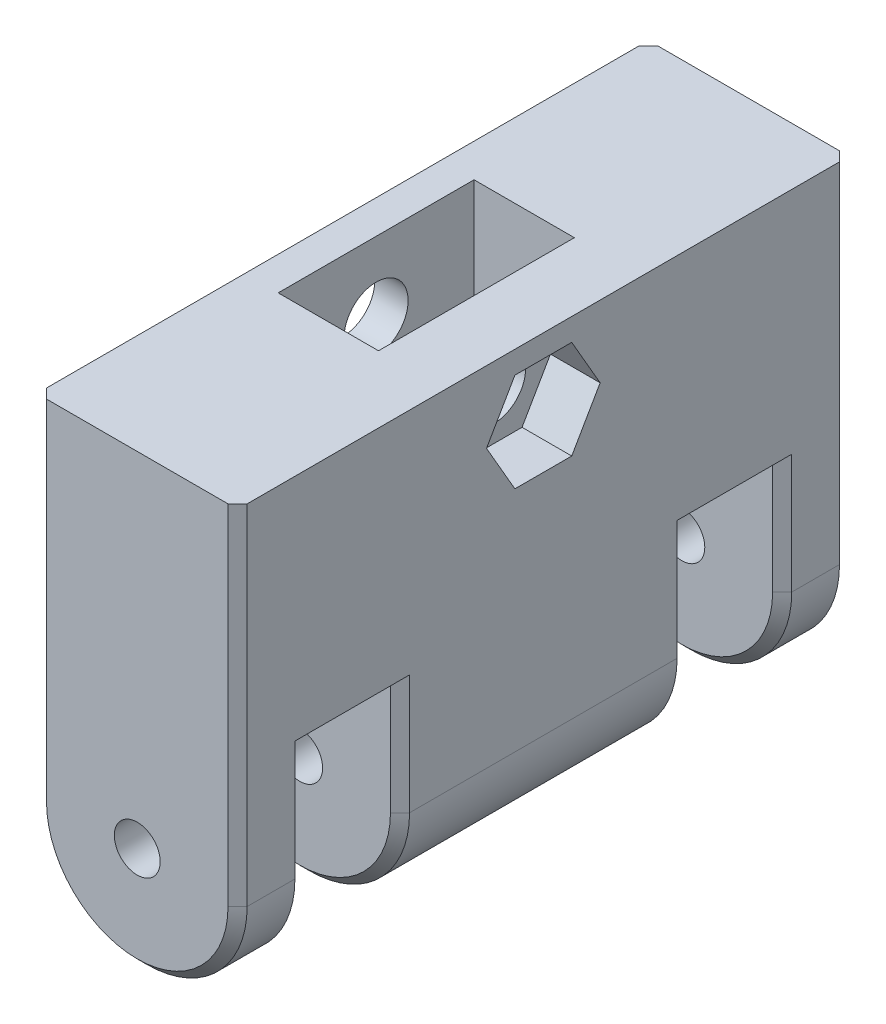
ISO-10303-21;
HEADER;
FILE_DESCRIPTION(('STEP AP214'),'2;1');
FILE_NAME('part.step','',(''),(''),'','','');
FILE_SCHEMA(('AUTOMOTIVE_DESIGN { 1 0 10303 214 1 1 1 1 }'));
ENDSEC;
DATA;
#1=APPLICATION_CONTEXT('core data for automotive mechanical design processes');
#2=APPLICATION_PROTOCOL_DEFINITION('international standard','automotive_design',2000,#1);
#3=PRODUCT_CONTEXT('',#1,'mechanical');
#4=PRODUCT('Part','Part','',(#3));
#5=PRODUCT_RELATED_PRODUCT_CATEGORY('part','',(#4));
#6=PRODUCT_DEFINITION_FORMATION('','',#4);
#7=PRODUCT_DEFINITION_CONTEXT('part definition',#1,'design');
#8=PRODUCT_DEFINITION('design','',#6,#7);
#9=PRODUCT_DEFINITION_SHAPE('','',#8);
#10=(LENGTH_UNIT() NAMED_UNIT(*) SI_UNIT(.MILLI.,.METRE.));
#11=(NAMED_UNIT(*) PLANE_ANGLE_UNIT() SI_UNIT($,.RADIAN.));
#12=(NAMED_UNIT(*) SI_UNIT($,.STERADIAN.) SOLID_ANGLE_UNIT());
#13=UNCERTAINTY_MEASURE_WITH_UNIT(LENGTH_MEASURE(1.E-05),#10,'distance_accuracy_value','');
#14=(GEOMETRIC_REPRESENTATION_CONTEXT(3) GLOBAL_UNCERTAINTY_ASSIGNED_CONTEXT((#13)) GLOBAL_UNIT_ASSIGNED_CONTEXT((#10,
#11,#12)) REPRESENTATION_CONTEXT('',''));
#15=CARTESIAN_POINT('',(0.,0.,0.));
#16=DIRECTION('',(0.,0.,1.));
#17=DIRECTION('',(1.,0.,0.));
#18=AXIS2_PLACEMENT_3D('',#15,#16,#17);
#19=CARTESIAN_POINT('',(-21.,0.,32.));
#20=DIRECTION('',(0.,1.,0.));
#21=DIRECTION('',(-1.,0.,0.));
#22=AXIS2_PLACEMENT_3D('',#19,#20,#21);
#23=PLANE('',#22);
#24=DIRECTION('',(-1.,0.,0.));
#25=VECTOR('',#24,1.);
#26=CARTESIAN_POINT('',(-21.,0.,-25.));
#27=LINE('',#26,#25);
#28=CARTESIAN_POINT('',(-1.00000000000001,0.,-25.));
#29=VERTEX_POINT('',#28);
#30=CARTESIAN_POINT('',(-20.,0.,-25.));
#31=VERTEX_POINT('',#30);
#32=EDGE_CURVE('E691',#29,#31,#27,.T.);
#33=ORIENTED_EDGE('',*,*,#32,.F.);
#34=DIRECTION('',(0.,0.,1.));
#35=VECTOR('',#34,1.);
#36=CARTESIAN_POINT('',(-1.00000000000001,0.,32.));
#37=LINE('',#36,#35);
#38=CARTESIAN_POINT('',(-1.,0.,-15.));
#39=VERTEX_POINT('',#38);
#40=EDGE_CURVE('E500',#29,#39,#37,.T.);
#41=ORIENTED_EDGE('',*,*,#40,.T.);
#42=DIRECTION('',(1.,0.,0.));
#43=VECTOR('',#42,1.);
#44=CARTESIAN_POINT('',(-21.,0.,-15.));
#45=LINE('',#44,#43);
#46=CARTESIAN_POINT('',(-20.,0.,-15.));
#47=VERTEX_POINT('',#46);
#48=EDGE_CURVE('E694',#47,#39,#45,.T.);
#49=ORIENTED_EDGE('',*,*,#48,.F.);
#50=DIRECTION('',(0.,0.,-1.));
#51=VECTOR('',#50,1.);
#52=CARTESIAN_POINT('',(-20.,0.,32.));
#53=LINE('',#52,#51);
#54=EDGE_CURVE('E498',#47,#31,#53,.T.);
#55=ORIENTED_EDGE('',*,*,#54,.T.);
#56=EDGE_LOOP('',(#33,#41,#49,#55));
#57=FACE_BOUND('',#56,.T.);
#58=ADVANCED_FACE('F36',(#57),#23,.F.);
#59=DIRECTION('',(-1.,0.,0.));
#60=VECTOR('',#59,1.);
#61=CARTESIAN_POINT('',(-21.,0.,15.));
#62=LINE('',#61,#60);
#63=CARTESIAN_POINT('',(-1.,0.,15.));
#64=VERTEX_POINT('',#63);
#65=CARTESIAN_POINT('',(-20.,0.,15.));
#66=VERTEX_POINT('',#65);
#67=EDGE_CURVE('E700',#64,#66,#62,.T.);
#68=ORIENTED_EDGE('',*,*,#67,.F.);
#69=DIRECTION('',(0.,0.,1.));
#70=VECTOR('',#69,1.);
#71=CARTESIAN_POINT('',(-1.00000000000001,0.,32.));
#72=LINE('',#71,#70);
#73=CARTESIAN_POINT('',(-1.,0.,25.));
#74=VERTEX_POINT('',#73);
#75=EDGE_CURVE('E504',#64,#74,#72,.T.);
#76=ORIENTED_EDGE('',*,*,#75,.T.);
#77=DIRECTION('',(1.,0.,0.));
#78=VECTOR('',#77,1.);
#79=CARTESIAN_POINT('',(-21.,0.,25.));
#80=LINE('',#79,#78);
#81=CARTESIAN_POINT('',(-20.,0.,25.));
#82=VERTEX_POINT('',#81);
#83=EDGE_CURVE('E326',#82,#74,#80,.T.);
#84=ORIENTED_EDGE('',*,*,#83,.F.);
#85=DIRECTION('',(0.,0.,-1.));
#86=VECTOR('',#85,1.);
#87=CARTESIAN_POINT('',(-20.,0.,32.));
#88=LINE('',#87,#86);
#89=EDGE_CURVE('E502',#82,#66,#88,.T.);
#90=ORIENTED_EDGE('',*,*,#89,.T.);
#91=EDGE_LOOP('',(#68,#76,#84,#90));
#92=FACE_BOUND('',#91,.T.);
#93=ADVANCED_FACE('F719',(#92),#23,.F.);
#94=CARTESIAN_POINT('',(0.,17.5,0.));
#95=DIRECTION('',(-1.,0.,0.));
#96=DIRECTION('',(0.,-1.,0.));
#97=AXIS2_PLACEMENT_3D('',#94,#95,#96);
#98=CYLINDRICAL_SURFACE('',#97,3.35);
#99=CARTESIAN_POINT('',(-7.,17.5,0.));
#100=DIRECTION('',(1.,0.,0.));
#101=DIRECTION('',(0.,0.,-1.));
#102=AXIS2_PLACEMENT_3D('',#99,#100,#101);
#103=CIRCLE('',#102,3.35);
#104=CARTESIAN_POINT('',(-7.,17.5,-3.35));
#105=VERTEX_POINT('',#104);
#106=EDGE_CURVE('E361',#105,#105,#103,.T.);
#107=ORIENTED_EDGE('',*,*,#106,.F.);
#108=EDGE_LOOP('',(#107));
#109=FACE_BOUND('',#108,.T.);
#110=CARTESIAN_POINT('',(-5.2,17.5,0.));
#111=DIRECTION('',(1.,0.,0.));
#112=DIRECTION('',(0.,0.,-1.));
#113=AXIS2_PLACEMENT_3D('',#110,#111,#112);
#114=CIRCLE('',#113,3.35);
#115=CARTESIAN_POINT('',(-5.2,17.5,-3.35));
#116=VERTEX_POINT('',#115);
#117=EDGE_CURVE('E349',#116,#116,#114,.F.);
#118=ORIENTED_EDGE('',*,*,#117,.F.);
#119=EDGE_LOOP('',(#118));
#120=FACE_BOUND('',#119,.T.);
#121=ADVANCED_FACE('F842',(#109,#120),#98,.F.);
#122=CARTESIAN_POINT('',(-21.,25.,32.));
#123=DIRECTION('',(1.,0.,0.));
#124=DIRECTION('',(0.,1.,0.));
#125=AXIS2_PLACEMENT_3D('',#122,#123,#124);
#126=PLANE('',#125);
#127=CARTESIAN_POINT('',(-21.,17.5,0.));
#128=DIRECTION('',(1.,0.,0.));
#129=DIRECTION('',(0.,1.,0.));
#130=AXIS2_PLACEMENT_3D('',#127,#128,#129);
#131=CIRCLE('',#130,3.35);
#132=CARTESIAN_POINT('',(-21.,20.85,0.));
#133=VERTEX_POINT('',#132);
#134=EDGE_CURVE('E360',#133,#133,#131,.T.);
#135=ORIENTED_EDGE('',*,*,#134,.T.);
#136=EDGE_LOOP('',(#135));
#137=FACE_BOUND('',#136,.T.);
#138=DIRECTION('',(0.,0.,-1.));
#139=VECTOR('',#138,1.);
#140=CARTESIAN_POINT('',(-21.,-11.5,32.));
#141=LINE('',#140,#139);
#142=CARTESIAN_POINT('',(-21.,-11.5,-31.));
#143=VERTEX_POINT('',#142);
#144=CARTESIAN_POINT('',(-21.,-11.5,-26.));
#145=VERTEX_POINT('',#144);
#146=EDGE_CURVE('E432',#143,#145,#141,.F.);
#147=ORIENTED_EDGE('',*,*,#146,.T.);
#148=DIRECTION('',(0.,1.,0.));
#149=VECTOR('',#148,1.);
#150=CARTESIAN_POINT('',(-21.,25.,-26.));
#151=LINE('',#150,#149);
#152=CARTESIAN_POINT('',(-21.,1.00000000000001,-26.));
#153=VERTEX_POINT('',#152);
#154=EDGE_CURVE('E460',#145,#153,#151,.T.);
#155=ORIENTED_EDGE('',*,*,#154,.T.);
#156=DIRECTION('',(0.,0.,1.));
#157=VECTOR('',#156,1.);
#158=CARTESIAN_POINT('',(-21.,1.00000000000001,32.));
#159=LINE('',#158,#157);
#160=CARTESIAN_POINT('',(-21.,1.00000000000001,-14.));
#161=VERTEX_POINT('',#160);
#162=EDGE_CURVE('E458',#153,#161,#159,.T.);
#163=ORIENTED_EDGE('',*,*,#162,.T.);
#164=DIRECTION('',(0.,-1.,0.));
#165=VECTOR('',#164,1.);
#166=CARTESIAN_POINT('',(-21.,25.,-14.));
#167=LINE('',#166,#165);
#168=CARTESIAN_POINT('',(-21.,-11.5,-14.));
#169=VERTEX_POINT('',#168);
#170=EDGE_CURVE('E456',#161,#169,#167,.T.);
#171=ORIENTED_EDGE('',*,*,#170,.T.);
#172=DIRECTION('',(0.,0.,-1.));
#173=VECTOR('',#172,1.);
#174=CARTESIAN_POINT('',(-21.,-11.5,15.));
#175=LINE('',#174,#173);
#176=CARTESIAN_POINT('',(-21.,-11.5,14.));
#177=VERTEX_POINT('',#176);
#178=EDGE_CURVE('E426',#169,#177,#175,.F.);
#179=ORIENTED_EDGE('',*,*,#178,.T.);
#180=DIRECTION('',(0.,1.,0.));
#181=VECTOR('',#180,1.);
#182=CARTESIAN_POINT('',(-21.,25.,14.));
#183=LINE('',#182,#181);
#184=CARTESIAN_POINT('',(-21.,1.00000000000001,14.));
#185=VERTEX_POINT('',#184);
#186=EDGE_CURVE('E454',#177,#185,#183,.T.);
#187=ORIENTED_EDGE('',*,*,#186,.T.);
#188=DIRECTION('',(0.,0.,1.));
#189=VECTOR('',#188,1.);
#190=CARTESIAN_POINT('',(-21.,1.00000000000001,32.));
#191=LINE('',#190,#189);
#192=CARTESIAN_POINT('',(-21.,1.00000000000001,26.));
#193=VERTEX_POINT('',#192);
#194=EDGE_CURVE('E452',#185,#193,#191,.T.);
#195=ORIENTED_EDGE('',*,*,#194,.T.);
#196=DIRECTION('',(0.,-1.,0.));
#197=VECTOR('',#196,1.);
#198=CARTESIAN_POINT('',(-21.,25.,26.));
#199=LINE('',#198,#197);
#200=CARTESIAN_POINT('',(-21.,-11.5,26.));
#201=VERTEX_POINT('',#200);
#202=EDGE_CURVE('E450',#193,#201,#199,.T.);
#203=ORIENTED_EDGE('',*,*,#202,.T.);
#204=DIRECTION('',(0.,0.,-1.));
#205=VECTOR('',#204,1.);
#206=CARTESIAN_POINT('',(-21.,-11.5,32.));
#207=LINE('',#206,#205);
#208=CARTESIAN_POINT('',(-21.,-11.5,31.));
#209=VERTEX_POINT('',#208);
#210=EDGE_CURVE('E429',#201,#209,#207,.F.);
#211=ORIENTED_EDGE('',*,*,#210,.T.);
#212=DIRECTION('',(0.,1.,0.));
#213=VECTOR('',#212,1.);
#214=CARTESIAN_POINT('',(-21.,25.,31.));
#215=LINE('',#214,#213);
#216=CARTESIAN_POINT('',(-21.,25.,31.));
#217=VERTEX_POINT('',#216);
#218=EDGE_CURVE('E435',#209,#217,#215,.T.);
#219=ORIENTED_EDGE('',*,*,#218,.T.);
#220=DIRECTION('',(0.,0.,-1.));
#221=VECTOR('',#220,1.);
#222=CARTESIAN_POINT('',(-21.,25.,32.));
#223=LINE('',#222,#221);
#224=CARTESIAN_POINT('',(-21.,25.,-31.));
#225=VERTEX_POINT('',#224);
#226=EDGE_CURVE('E400',#217,#225,#223,.T.);
#227=ORIENTED_EDGE('',*,*,#226,.T.);
#228=DIRECTION('',(0.,-1.,0.));
#229=VECTOR('',#228,1.);
#230=CARTESIAN_POINT('',(-21.,25.,-31.));
#231=LINE('',#230,#229);
#232=EDGE_CURVE('E448',#225,#143,#231,.T.);
#233=ORIENTED_EDGE('',*,*,#232,.T.);
#234=EDGE_LOOP('',(#147,#155,#163,#171,#179,#187,#195,#203,#211,#219,#227,#233));
#235=FACE_BOUND('',#234,.T.);
#236=ADVANCED_FACE('F648',(#137,#235),#126,.F.);
#237=CARTESIAN_POINT('',(0.,25.,32.));
#238=DIRECTION('',(-1.,0.,0.));
#239=DIRECTION('',(0.,0.,1.));
#240=AXIS2_PLACEMENT_3D('',#237,#238,#239);
#241=PLANE('',#240);
#242=DIRECTION('',(0.,0.,1.));
#243=VECTOR('',#242,1.);
#244=CARTESIAN_POINT('',(0.,22.65,-2.97335388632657));
#245=LINE('',#244,#243);
#246=CARTESIAN_POINT('',(0.,22.65,-2.97335388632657));
#247=VERTEX_POINT('',#246);
#248=CARTESIAN_POINT('',(0.,22.65,2.97335388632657));
#249=VERTEX_POINT('',#248);
#250=EDGE_CURVE('E337',#247,#249,#245,.T.);
#251=ORIENTED_EDGE('',*,*,#250,.F.);
#252=DIRECTION('',(0.,0.866025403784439,0.5));
#253=VECTOR('',#252,1.);
#254=CARTESIAN_POINT('',(0.,17.5,-5.94670777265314));
#255=LINE('',#254,#253);
#256=CARTESIAN_POINT('',(0.,17.5,-5.94670777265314));
#257=VERTEX_POINT('',#256);
#258=EDGE_CURVE('E301',#257,#247,#255,.T.);
#259=ORIENTED_EDGE('',*,*,#258,.F.);
#260=DIRECTION('',(0.,0.866025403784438,-0.5));
#261=VECTOR('',#260,1.);
#262=CARTESIAN_POINT('',(0.,12.35,-2.97335388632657));
#263=LINE('',#262,#261);
#264=CARTESIAN_POINT('',(0.,12.35,-2.97335388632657));
#265=VERTEX_POINT('',#264);
#266=EDGE_CURVE('E320',#265,#257,#263,.T.);
#267=ORIENTED_EDGE('',*,*,#266,.F.);
#268=DIRECTION('',(0.,0.,-1.));
#269=VECTOR('',#268,1.);
#270=CARTESIAN_POINT('',(0.,12.35,2.97335388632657));
#271=LINE('',#270,#269);
#272=CARTESIAN_POINT('',(0.,12.35,2.97335388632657));
#273=VERTEX_POINT('',#272);
#274=EDGE_CURVE('E323',#273,#265,#271,.T.);
#275=ORIENTED_EDGE('',*,*,#274,.F.);
#276=DIRECTION('',(0.,-0.866025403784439,-0.5));
#277=VECTOR('',#276,1.);
#278=CARTESIAN_POINT('',(0.,17.5,5.94670777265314));
#279=LINE('',#278,#277);
#280=CARTESIAN_POINT('',(0.,17.5,5.94670777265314));
#281=VERTEX_POINT('',#280);
#282=EDGE_CURVE('E342',#281,#273,#279,.T.);
#283=ORIENTED_EDGE('',*,*,#282,.F.);
#284=DIRECTION('',(0.,-0.866025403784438,0.5));
#285=VECTOR('',#284,1.);
#286=CARTESIAN_POINT('',(0.,22.65,2.97335388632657));
#287=LINE('',#286,#285);
#288=EDGE_CURVE('E339',#249,#281,#287,.T.);
#289=ORIENTED_EDGE('',*,*,#288,.F.);
#290=EDGE_LOOP('',(#251,#259,#267,#275,#283,#289));
#291=FACE_BOUND('',#290,.T.);
#292=DIRECTION('',(0.,0.,-1.));
#293=VECTOR('',#292,1.);
#294=CARTESIAN_POINT('',(0.,1.00000000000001,32.));
#295=LINE('',#294,#293);
#296=CARTESIAN_POINT('',(0.,1.00000000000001,-14.));
#297=VERTEX_POINT('',#296);
#298=CARTESIAN_POINT('',(0.,1.00000000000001,-26.));
#299=VERTEX_POINT('',#298);
#300=EDGE_CURVE('E494',#297,#299,#295,.T.);
#301=ORIENTED_EDGE('',*,*,#300,.T.);
#302=DIRECTION('',(0.,-1.,0.));
#303=VECTOR('',#302,1.);
#304=CARTESIAN_POINT('',(0.,25.,-26.));
#305=LINE('',#304,#303);
#306=CARTESIAN_POINT('',(0.,-11.5,-26.));
#307=VERTEX_POINT('',#306);
#308=EDGE_CURVE('E496',#299,#307,#305,.T.);
#309=ORIENTED_EDGE('',*,*,#308,.T.);
#310=DIRECTION('',(0.,0.,1.));
#311=VECTOR('',#310,1.);
#312=CARTESIAN_POINT('',(0.,-11.5,32.));
#313=LINE('',#312,#311);
#314=CARTESIAN_POINT('',(0.,-11.5,-31.));
#315=VERTEX_POINT('',#314);
#316=EDGE_CURVE('E423',#307,#315,#313,.F.);
#317=ORIENTED_EDGE('',*,*,#316,.T.);
#318=DIRECTION('',(0.,1.,0.));
#319=VECTOR('',#318,1.);
#320=CARTESIAN_POINT('',(0.,25.,-31.));
#321=LINE('',#320,#319);
#322=CARTESIAN_POINT('',(0.,25.,-31.));
#323=VERTEX_POINT('',#322);
#324=EDGE_CURVE('E482',#315,#323,#321,.T.);
#325=ORIENTED_EDGE('',*,*,#324,.T.);
#326=DIRECTION('',(0.,0.,-1.));
#327=VECTOR('',#326,1.);
#328=CARTESIAN_POINT('',(0.,25.,32.));
#329=LINE('',#328,#327);
#330=CARTESIAN_POINT('',(0.,25.,31.));
#331=VERTEX_POINT('',#330);
#332=EDGE_CURVE('E405',#331,#323,#329,.T.);
#333=ORIENTED_EDGE('',*,*,#332,.F.);
#334=DIRECTION('',(0.,-1.,0.));
#335=VECTOR('',#334,1.);
#336=CARTESIAN_POINT('',(0.,-11.5,31.));
#337=LINE('',#336,#335);
#338=CARTESIAN_POINT('',(0.,-11.5,31.));
#339=VERTEX_POINT('',#338);
#340=EDGE_CURVE('E480',#331,#339,#337,.T.);
#341=ORIENTED_EDGE('',*,*,#340,.T.);
#342=DIRECTION('',(0.,0.,1.));
#343=VECTOR('',#342,1.);
#344=CARTESIAN_POINT('',(0.,-11.5,25.));
#345=LINE('',#344,#343);
#346=CARTESIAN_POINT('',(0.,-11.5,26.));
#347=VERTEX_POINT('',#346);
#348=EDGE_CURVE('E420',#339,#347,#345,.F.);
#349=ORIENTED_EDGE('',*,*,#348,.T.);
#350=DIRECTION('',(0.,1.,0.));
#351=VECTOR('',#350,1.);
#352=CARTESIAN_POINT('',(0.,25.,26.));
#353=LINE('',#352,#351);
#354=CARTESIAN_POINT('',(0.,1.00000000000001,26.));
#355=VERTEX_POINT('',#354);
#356=EDGE_CURVE('E485',#347,#355,#353,.T.);
#357=ORIENTED_EDGE('',*,*,#356,.T.);
#358=DIRECTION('',(0.,0.,-1.));
#359=VECTOR('',#358,1.);
#360=CARTESIAN_POINT('',(0.,1.00000000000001,32.));
#361=LINE('',#360,#359);
#362=CARTESIAN_POINT('',(0.,1.00000000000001,14.));
#363=VERTEX_POINT('',#362);
#364=EDGE_CURVE('E487',#355,#363,#361,.T.);
#365=ORIENTED_EDGE('',*,*,#364,.T.);
#366=DIRECTION('',(0.,-1.,0.));
#367=VECTOR('',#366,1.);
#368=CARTESIAN_POINT('',(0.,25.,14.));
#369=LINE('',#368,#367);
#370=CARTESIAN_POINT('',(0.,-11.5,14.));
#371=VERTEX_POINT('',#370);
#372=EDGE_CURVE('E490',#363,#371,#369,.T.);
#373=ORIENTED_EDGE('',*,*,#372,.T.);
#374=DIRECTION('',(0.,0.,1.));
#375=VECTOR('',#374,1.);
#376=CARTESIAN_POINT('',(0.,-11.5,-15.));
#377=LINE('',#376,#375);
#378=CARTESIAN_POINT('',(0.,-11.5,-14.));
#379=VERTEX_POINT('',#378);
#380=EDGE_CURVE('E408',#371,#379,#377,.F.);
#381=ORIENTED_EDGE('',*,*,#380,.T.);
#382=DIRECTION('',(0.,1.,0.));
#383=VECTOR('',#382,1.);
#384=CARTESIAN_POINT('',(0.,25.,-14.));
#385=LINE('',#384,#383);
#386=EDGE_CURVE('E492',#379,#297,#385,.T.);
#387=ORIENTED_EDGE('',*,*,#386,.T.);
#388=EDGE_LOOP('',(#301,#309,#317,#325,#333,#341,#349,#357,#365,#373,#381,#387));
#389=FACE_BOUND('',#388,.T.);
#390=ADVANCED_FACE('F751',(#291,#389),#241,.F.);
#391=CARTESIAN_POINT('',(-21.,25.,32.));
#392=DIRECTION('',(0.,-1.,0.));
#393=DIRECTION('',(1.,0.,0.));
#394=AXIS2_PLACEMENT_3D('',#391,#392,#393);
#395=PLANE('',#394);
#396=DIRECTION('',(1.,0.,0.));
#397=VECTOR('',#396,1.);
#398=CARTESIAN_POINT('',(-17.5,25.,10.25));
#399=LINE('',#398,#397);
#400=CARTESIAN_POINT('',(-17.5,25.,10.25));
#401=VERTEX_POINT('',#400);
#402=CARTESIAN_POINT('',(-7.,25.,10.25));
#403=VERTEX_POINT('',#402);
#404=EDGE_CURVE('E380',#401,#403,#399,.T.);
#405=ORIENTED_EDGE('',*,*,#404,.F.);
#406=DIRECTION('',(0.,0.,1.));
#407=VECTOR('',#406,1.);
#408=CARTESIAN_POINT('',(-17.5,25.,-10.25));
#409=LINE('',#408,#407);
#410=CARTESIAN_POINT('',(-17.5,25.,-10.25));
#411=VERTEX_POINT('',#410);
#412=EDGE_CURVE('E364',#411,#401,#409,.T.);
#413=ORIENTED_EDGE('',*,*,#412,.F.);
#414=DIRECTION('',(-1.,0.,0.));
#415=VECTOR('',#414,1.);
#416=CARTESIAN_POINT('',(-17.5,25.,-10.25));
#417=LINE('',#416,#415);
#418=CARTESIAN_POINT('',(-7.,25.,-10.25));
#419=VERTEX_POINT('',#418);
#420=EDGE_CURVE('E369',#419,#411,#417,.T.);
#421=ORIENTED_EDGE('',*,*,#420,.F.);
#422=DIRECTION('',(0.,0.,-1.));
#423=VECTOR('',#422,1.);
#424=CARTESIAN_POINT('',(-7.,25.,-10.25));
#425=LINE('',#424,#423);
#426=EDGE_CURVE('E383',#403,#419,#425,.T.);
#427=ORIENTED_EDGE('',*,*,#426,.F.);
#428=EDGE_LOOP('',(#405,#413,#421,#427));
#429=FACE_BOUND('',#428,.T.);
#430=ORIENTED_EDGE('',*,*,#332,.T.);
#431=DIRECTION('',(0.707106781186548,0.,0.707106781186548));
#432=VECTOR('',#431,1.);
#433=CARTESIAN_POINT('',(0.,25.,-31.));
#434=LINE('',#433,#432);
#435=CARTESIAN_POINT('',(-1.,25.,-32.));
#436=VERTEX_POINT('',#435);
#437=EDGE_CURVE('E553',#323,#436,#434,.F.);
#438=ORIENTED_EDGE('',*,*,#437,.T.);
#439=DIRECTION('',(-1.,0.,0.));
#440=VECTOR('',#439,1.);
#441=CARTESIAN_POINT('',(-21.,25.,-32.));
#442=LINE('',#441,#440);
#443=CARTESIAN_POINT('',(-20.,25.,-32.));
#444=VERTEX_POINT('',#443);
#445=EDGE_CURVE('E390',#436,#444,#442,.T.);
#446=ORIENTED_EDGE('',*,*,#445,.T.);
#447=DIRECTION('',(0.707106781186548,0.,-0.707106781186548));
#448=VECTOR('',#447,1.);
#449=CARTESIAN_POINT('',(-21.,25.,-31.));
#450=LINE('',#449,#448);
#451=EDGE_CURVE('E551',#444,#225,#450,.F.);
#452=ORIENTED_EDGE('',*,*,#451,.T.);
#453=ORIENTED_EDGE('',*,*,#226,.F.);
#454=DIRECTION('',(0.707106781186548,0.,0.707106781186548));
#455=VECTOR('',#454,1.);
#456=CARTESIAN_POINT('',(-20.,25.,32.));
#457=LINE('',#456,#455);
#458=CARTESIAN_POINT('',(-20.,25.,32.));
#459=VERTEX_POINT('',#458);
#460=EDGE_CURVE('E547',#217,#459,#457,.T.);
#461=ORIENTED_EDGE('',*,*,#460,.T.);
#462=DIRECTION('',(-1.,0.,0.));
#463=VECTOR('',#462,1.);
#464=CARTESIAN_POINT('',(-21.,25.,32.));
#465=LINE('',#464,#463);
#466=CARTESIAN_POINT('',(-0.999999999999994,25.,32.));
#467=VERTEX_POINT('',#466);
#468=EDGE_CURVE('E397',#467,#459,#465,.T.);
#469=ORIENTED_EDGE('',*,*,#468,.F.);
#470=DIRECTION('',(0.707106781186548,0.,-0.707106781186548));
#471=VECTOR('',#470,1.);
#472=CARTESIAN_POINT('',(-1.,25.,32.));
#473=LINE('',#472,#471);
#474=EDGE_CURVE('E549',#467,#331,#473,.T.);
#475=ORIENTED_EDGE('',*,*,#474,.T.);
#476=EDGE_LOOP('',(#430,#438,#446,#452,#453,#461,#469,#475));
#477=FACE_BOUND('',#476,.T.);
#478=ADVANCED_FACE('F652',(#429,#477),#395,.F.);
#479=CARTESIAN_POINT('',(0.,0.,32.));
#480=DIRECTION('',(0.,0.,1.));
#481=DIRECTION('',(1.,0.,0.));
#482=AXIS2_PLACEMENT_3D('',#479,#480,#481);
#483=PLANE('',#482);
#484=CARTESIAN_POINT('',(-10.5,-11.,32.));
#485=DIRECTION('',(0.,0.,1.));
#486=DIRECTION('',(1.,0.,0.));
#487=AXIS2_PLACEMENT_3D('',#484,#485,#486);
#488=CIRCLE('',#487,2.4);
#489=CARTESIAN_POINT('',(-8.1,-11.,32.));
#490=VERTEX_POINT('',#489);
#491=EDGE_CURVE('E439',#490,#490,#488,.T.);
#492=ORIENTED_EDGE('',*,*,#491,.F.);
#493=EDGE_LOOP('',(#492));
#494=FACE_BOUND('',#493,.T.);
#495=CARTESIAN_POINT('',(-10.5,-11.5,32.));
#496=DIRECTION('',(0.,0.,1.));
#497=DIRECTION('',(1.,0.,0.));
#498=AXIS2_PLACEMENT_3D('',#495,#496,#497);
#499=CIRCLE('',#498,9.50000000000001);
#500=CARTESIAN_POINT('',(-10.5,-21.,32.));
#501=VERTEX_POINT('',#500);
#502=CARTESIAN_POINT('',(-0.999999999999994,-11.5,32.));
#503=VERTEX_POINT('',#502);
#504=EDGE_CURVE('E46',#501,#503,#499,.T.);
#505=ORIENTED_EDGE('',*,*,#504,.T.);
#506=DIRECTION('',(0.,1.,0.));
#507=VECTOR('',#506,1.);
#508=CARTESIAN_POINT('',(-0.999999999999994,25.,32.));
#509=LINE('',#508,#507);
#510=EDGE_CURVE('E11',#503,#467,#509,.T.);
#511=ORIENTED_EDGE('',*,*,#510,.T.);
#512=ORIENTED_EDGE('',*,*,#468,.T.);
#513=DIRECTION('',(0.,-1.,0.));
#514=VECTOR('',#513,1.);
#515=CARTESIAN_POINT('',(-20.,-11.5,32.));
#516=LINE('',#515,#514);
#517=CARTESIAN_POINT('',(-20.,-11.5,32.));
#518=VERTEX_POINT('',#517);
#519=EDGE_CURVE('E563',#459,#518,#516,.T.);
#520=ORIENTED_EDGE('',*,*,#519,.T.);
#521=CARTESIAN_POINT('',(-10.5,-11.5,32.));
#522=DIRECTION('',(0.,0.,1.));
#523=DIRECTION('',(1.,0.,0.));
#524=AXIS2_PLACEMENT_3D('',#521,#522,#523);
#525=CIRCLE('',#524,9.50000000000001);
#526=EDGE_CURVE('E57',#518,#501,#525,.T.);
#527=ORIENTED_EDGE('',*,*,#526,.T.);
#528=EDGE_LOOP('',(#505,#511,#512,#520,#527));
#529=FACE_BOUND('',#528,.T.);
#530=ADVANCED_FACE('F758',(#494,#529),#483,.T.);
#531=CARTESIAN_POINT('',(0.,0.,-32.));
#532=DIRECTION('',(0.,0.,1.));
#533=DIRECTION('',(1.,0.,0.));
#534=AXIS2_PLACEMENT_3D('',#531,#532,#533);
#535=PLANE('',#534);
#536=CARTESIAN_POINT('',(-10.5,-11.,-32.));
#537=DIRECTION('',(0.,0.,1.));
#538=DIRECTION('',(1.,0.,0.));
#539=AXIS2_PLACEMENT_3D('',#536,#537,#538);
#540=CIRCLE('',#539,2.4);
#541=CARTESIAN_POINT('',(-8.1,-11.,-32.));
#542=VERTEX_POINT('',#541);
#543=EDGE_CURVE('E417',#542,#542,#540,.T.);
#544=ORIENTED_EDGE('',*,*,#543,.T.);
#545=EDGE_LOOP('',(#544));
#546=FACE_BOUND('',#545,.T.);
#547=ORIENTED_EDGE('',*,*,#445,.F.);
#548=DIRECTION('',(0.,-1.,0.));
#549=VECTOR('',#548,1.);
#550=CARTESIAN_POINT('',(-1.,0.,-32.));
#551=LINE('',#550,#549);
#552=CARTESIAN_POINT('',(-1.,-11.5,-32.));
#553=VERTEX_POINT('',#552);
#554=EDGE_CURVE('E561',#436,#553,#551,.T.);
#555=ORIENTED_EDGE('',*,*,#554,.T.);
#556=CARTESIAN_POINT('',(-10.5,-11.5,-32.));
#557=DIRECTION('',(0.,0.,1.));
#558=DIRECTION('',(1.,0.,0.));
#559=AXIS2_PLACEMENT_3D('',#556,#557,#558);
#560=CIRCLE('',#559,9.5);
#561=CARTESIAN_POINT('',(-10.5,-21.,-32.));
#562=VERTEX_POINT('',#561);
#563=EDGE_CURVE('E559',#553,#562,#560,.F.);
#564=ORIENTED_EDGE('',*,*,#563,.T.);
#565=CARTESIAN_POINT('',(-10.5,-11.5,-32.));
#566=DIRECTION('',(0.,0.,1.));
#567=DIRECTION('',(1.,0.,0.));
#568=AXIS2_PLACEMENT_3D('',#565,#566,#567);
#569=CIRCLE('',#568,9.5);
#570=CARTESIAN_POINT('',(-20.,-11.5,-32.));
#571=VERTEX_POINT('',#570);
#572=EDGE_CURVE('E557',#562,#571,#569,.F.);
#573=ORIENTED_EDGE('',*,*,#572,.T.);
#574=DIRECTION('',(0.,1.,0.));
#575=VECTOR('',#574,1.);
#576=CARTESIAN_POINT('',(-20.,0.,-32.));
#577=LINE('',#576,#575);
#578=EDGE_CURVE('E555',#571,#444,#577,.T.);
#579=ORIENTED_EDGE('',*,*,#578,.T.);
#580=EDGE_LOOP('',(#547,#555,#564,#573,#579));
#581=FACE_BOUND('',#580,.T.);
#582=ADVANCED_FACE('F766',(#546,#581),#535,.F.);
#583=CARTESIAN_POINT('',(-17.5,6.50000000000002,-10.25));
#584=DIRECTION('',(-1.,0.,0.));
#585=DIRECTION('',(0.,0.,1.));
#586=AXIS2_PLACEMENT_3D('',#583,#584,#585);
#587=PLANE('',#586);
#588=CARTESIAN_POINT('',(-17.5,17.5,0.));
#589=DIRECTION('',(-1.,0.,0.));
#590=DIRECTION('',(0.,0.,1.));
#591=AXIS2_PLACEMENT_3D('',#588,#589,#590);
#592=CIRCLE('',#591,3.35);
#593=CARTESIAN_POINT('',(-17.5,17.5,3.35));
#594=VERTEX_POINT('',#593);
#595=EDGE_CURVE('E357',#594,#594,#592,.T.);
#596=ORIENTED_EDGE('',*,*,#595,.T.);
#597=EDGE_LOOP('',(#596));
#598=FACE_BOUND('',#597,.T.);
#599=ORIENTED_EDGE('',*,*,#412,.T.);
#600=DIRECTION('',(0.,1.,0.));
#601=VECTOR('',#600,1.);
#602=CARTESIAN_POINT('',(-17.5,6.50000000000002,10.25));
#603=LINE('',#602,#601);
#604=CARTESIAN_POINT('',(-17.5,6.50000000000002,10.25));
#605=VERTEX_POINT('',#604);
#606=EDGE_CURVE('E378',#605,#401,#603,.T.);
#607=ORIENTED_EDGE('',*,*,#606,.F.);
#608=DIRECTION('',(0.,0.,1.));
#609=VECTOR('',#608,1.);
#610=CARTESIAN_POINT('',(-17.5,6.50000000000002,-10.25));
#611=LINE('',#610,#609);
#612=CARTESIAN_POINT('',(-17.5,6.50000000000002,-10.25));
#613=VERTEX_POINT('',#612);
#614=EDGE_CURVE('E365',#613,#605,#611,.T.);
#615=ORIENTED_EDGE('',*,*,#614,.F.);
#616=DIRECTION('',(0.,1.,0.));
#617=VECTOR('',#616,1.);
#618=CARTESIAN_POINT('',(-17.5,6.50000000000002,-10.25));
#619=LINE('',#618,#617);
#620=EDGE_CURVE('E388',#613,#411,#619,.T.);
#621=ORIENTED_EDGE('',*,*,#620,.T.);
#622=EDGE_LOOP('',(#599,#607,#615,#621));
#623=FACE_BOUND('',#622,.T.);
#624=ADVANCED_FACE('F1255',(#598,#623),#587,.F.);
#625=CARTESIAN_POINT('',(-17.5,6.50000000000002,-10.25));
#626=DIRECTION('',(0.,0.,-1.));
#627=DIRECTION('',(-1.,0.,0.));
#628=AXIS2_PLACEMENT_3D('',#625,#626,#627);
#629=PLANE('',#628);
#630=ORIENTED_EDGE('',*,*,#420,.T.);
#631=ORIENTED_EDGE('',*,*,#620,.F.);
#632=DIRECTION('',(-1.,0.,0.));
#633=VECTOR('',#632,1.);
#634=CARTESIAN_POINT('',(-17.5,6.50000000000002,-10.25));
#635=LINE('',#634,#633);
#636=CARTESIAN_POINT('',(-7.,6.50000000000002,-10.25));
#637=VERTEX_POINT('',#636);
#638=EDGE_CURVE('E375',#637,#613,#635,.T.);
#639=ORIENTED_EDGE('',*,*,#638,.F.);
#640=DIRECTION('',(0.,1.,0.));
#641=VECTOR('',#640,1.);
#642=CARTESIAN_POINT('',(-7.,6.50000000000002,-10.25));
#643=LINE('',#642,#641);
#644=EDGE_CURVE('E391',#637,#419,#643,.T.);
#645=ORIENTED_EDGE('',*,*,#644,.T.);
#646=EDGE_LOOP('',(#630,#631,#639,#645));
#647=FACE_BOUND('',#646,.T.);
#648=ADVANCED_FACE('F1303',(#647),#629,.F.);
#649=CARTESIAN_POINT('',(-7.,6.50000000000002,-10.25));
#650=DIRECTION('',(1.,0.,0.));
#651=DIRECTION('',(0.,0.,-1.));
#652=AXIS2_PLACEMENT_3D('',#649,#650,#651);
#653=PLANE('',#652);
#654=ORIENTED_EDGE('',*,*,#106,.T.);
#655=EDGE_LOOP('',(#654));
#656=FACE_BOUND('',#655,.T.);
#657=ORIENTED_EDGE('',*,*,#426,.T.);
#658=ORIENTED_EDGE('',*,*,#644,.F.);
#659=DIRECTION('',(0.,0.,-1.));
#660=VECTOR('',#659,1.);
#661=CARTESIAN_POINT('',(-7.,6.50000000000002,-10.25));
#662=LINE('',#661,#660);
#663=CARTESIAN_POINT('',(-7.,6.50000000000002,10.25));
#664=VERTEX_POINT('',#663);
#665=EDGE_CURVE('E372',#664,#637,#662,.T.);
#666=ORIENTED_EDGE('',*,*,#665,.F.);
#667=DIRECTION('',(0.,1.,0.));
#668=VECTOR('',#667,1.);
#669=CARTESIAN_POINT('',(-7.,6.50000000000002,10.25));
#670=LINE('',#669,#668);
#671=EDGE_CURVE('E393',#664,#403,#670,.T.);
#672=ORIENTED_EDGE('',*,*,#671,.T.);
#673=EDGE_LOOP('',(#657,#658,#666,#672));
#674=FACE_BOUND('',#673,.T.);
#675=ADVANCED_FACE('F1312',(#656,#674),#653,.F.);
#676=CARTESIAN_POINT('',(-17.5,6.50000000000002,10.25));
#677=DIRECTION('',(0.,0.,1.));
#678=DIRECTION('',(1.,0.,0.));
#679=AXIS2_PLACEMENT_3D('',#676,#677,#678);
#680=PLANE('',#679);
#681=ORIENTED_EDGE('',*,*,#404,.T.);
#682=ORIENTED_EDGE('',*,*,#671,.F.);
#683=DIRECTION('',(1.,0.,0.));
#684=VECTOR('',#683,1.);
#685=CARTESIAN_POINT('',(-17.5,6.50000000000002,10.25));
#686=LINE('',#685,#684);
#687=EDGE_CURVE('E368',#605,#664,#686,.T.);
#688=ORIENTED_EDGE('',*,*,#687,.F.);
#689=ORIENTED_EDGE('',*,*,#606,.T.);
#690=EDGE_LOOP('',(#681,#682,#688,#689));
#691=FACE_BOUND('',#690,.T.);
#692=ADVANCED_FACE('F1320',(#691),#680,.F.);
#693=CARTESIAN_POINT('',(0.,6.50000000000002,0.));
#694=DIRECTION('',(0.,1.,0.));
#695=DIRECTION('',(0.,0.,1.));
#696=AXIS2_PLACEMENT_3D('',#693,#694,#695);
#697=PLANE('',#696);
#698=ORIENTED_EDGE('',*,*,#614,.T.);
#699=ORIENTED_EDGE('',*,*,#687,.T.);
#700=ORIENTED_EDGE('',*,*,#665,.T.);
#701=ORIENTED_EDGE('',*,*,#638,.T.);
#702=EDGE_LOOP('',(#698,#699,#700,#701));
#703=FACE_BOUND('',#702,.T.);
#704=ADVANCED_FACE('F1328',(#703),#697,.T.);
#705=ORIENTED_EDGE('',*,*,#595,.F.);
#706=EDGE_LOOP('',(#705));
#707=FACE_BOUND('',#706,.T.);
#708=ORIENTED_EDGE('',*,*,#134,.F.);
#709=EDGE_LOOP('',(#708));
#710=FACE_BOUND('',#709,.T.);
#711=ADVANCED_FACE('F1335',(#707,#710),#98,.F.);
#712=CARTESIAN_POINT('',(-5.2,0.,0.));
#713=DIRECTION('',(1.,0.,0.));
#714=DIRECTION('',(0.,0.,-1.));
#715=AXIS2_PLACEMENT_3D('',#712,#713,#714);
#716=PLANE('',#715);
#717=DIRECTION('',(0.,0.866025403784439,0.5));
#718=VECTOR('',#717,1.);
#719=CARTESIAN_POINT('',(-5.2,17.5,-5.94670777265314));
#720=LINE('',#719,#718);
#721=CARTESIAN_POINT('',(-5.2,17.5,-5.94670777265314));
#722=VERTEX_POINT('',#721);
#723=CARTESIAN_POINT('',(-5.2,22.65,-2.97335388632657));
#724=VERTEX_POINT('',#723);
#725=EDGE_CURVE('E298',#722,#724,#720,.T.);
#726=ORIENTED_EDGE('',*,*,#725,.T.);
#727=DIRECTION('',(0.,0.,1.));
#728=VECTOR('',#727,1.);
#729=CARTESIAN_POINT('',(-5.2,22.65,-2.97335388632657));
#730=LINE('',#729,#728);
#731=CARTESIAN_POINT('',(-5.2,22.65,2.97335388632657));
#732=VERTEX_POINT('',#731);
#733=EDGE_CURVE('E309',#724,#732,#730,.T.);
#734=ORIENTED_EDGE('',*,*,#733,.T.);
#735=DIRECTION('',(0.,-0.866025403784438,0.5));
#736=VECTOR('',#735,1.);
#737=CARTESIAN_POINT('',(-5.2,22.65,2.97335388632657));
#738=LINE('',#737,#736);
#739=CARTESIAN_POINT('',(-5.2,17.5,5.94670777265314));
#740=VERTEX_POINT('',#739);
#741=EDGE_CURVE('E314',#732,#740,#738,.T.);
#742=ORIENTED_EDGE('',*,*,#741,.T.);
#743=DIRECTION('',(0.,-0.866025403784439,-0.5));
#744=VECTOR('',#743,1.);
#745=CARTESIAN_POINT('',(-5.2,17.5,5.94670777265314));
#746=LINE('',#745,#744);
#747=CARTESIAN_POINT('',(-5.2,12.35,2.97335388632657));
#748=VERTEX_POINT('',#747);
#749=EDGE_CURVE('E330',#740,#748,#746,.T.);
#750=ORIENTED_EDGE('',*,*,#749,.T.);
#751=DIRECTION('',(0.,0.,-1.));
#752=VECTOR('',#751,1.);
#753=CARTESIAN_POINT('',(-5.2,12.35,2.97335388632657));
#754=LINE('',#753,#752);
#755=CARTESIAN_POINT('',(-5.2,12.35,-2.97335388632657));
#756=VERTEX_POINT('',#755);
#757=EDGE_CURVE('E333',#748,#756,#754,.T.);
#758=ORIENTED_EDGE('',*,*,#757,.T.);
#759=DIRECTION('',(0.,0.866025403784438,-0.5));
#760=VECTOR('',#759,1.);
#761=CARTESIAN_POINT('',(-5.2,12.35,-2.97335388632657));
#762=LINE('',#761,#760);
#763=EDGE_CURVE('E306',#756,#722,#762,.T.);
#764=ORIENTED_EDGE('',*,*,#763,.T.);
#765=EDGE_LOOP('',(#726,#734,#742,#750,#758,#764));
#766=FACE_BOUND('',#765,.T.);
#767=ORIENTED_EDGE('',*,*,#117,.T.);
#768=EDGE_LOOP('',(#767));
#769=FACE_BOUND('',#768,.T.);
#770=ADVANCED_FACE('F316',(#766,#769),#716,.T.);
#771=CARTESIAN_POINT('',(-5.2,17.5,-5.94670777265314));
#772=DIRECTION('',(0.,0.5,-0.866025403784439));
#773=DIRECTION('',(0.,0.866025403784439,0.5));
#774=AXIS2_PLACEMENT_3D('',#771,#772,#773);
#775=PLANE('',#774);
#776=ORIENTED_EDGE('',*,*,#258,.T.);
#777=DIRECTION('',(1.,0.,0.));
#778=VECTOR('',#777,1.);
#779=CARTESIAN_POINT('',(-5.2,22.65,-2.97335388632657));
#780=LINE('',#779,#778);
#781=EDGE_CURVE('E294',#724,#247,#780,.T.);
#782=ORIENTED_EDGE('',*,*,#781,.F.);
#783=ORIENTED_EDGE('',*,*,#725,.F.);
#784=DIRECTION('',(1.,0.,0.));
#785=VECTOR('',#784,1.);
#786=CARTESIAN_POINT('',(-5.2,17.5,-5.94670777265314));
#787=LINE('',#786,#785);
#788=EDGE_CURVE('E347',#722,#257,#787,.T.);
#789=ORIENTED_EDGE('',*,*,#788,.T.);
#790=EDGE_LOOP('',(#776,#782,#783,#789));
#791=FACE_BOUND('',#790,.T.);
#792=ADVANCED_FACE('F296',(#791),#775,.F.);
#793=CARTESIAN_POINT('',(-5.2,12.35,-2.97335388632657));
#794=DIRECTION('',(0.,-0.5,-0.866025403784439));
#795=DIRECTION('',(0.,0.866025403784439,-0.5));
#796=AXIS2_PLACEMENT_3D('',#793,#794,#795);
#797=PLANE('',#796);
#798=ORIENTED_EDGE('',*,*,#266,.T.);
#799=ORIENTED_EDGE('',*,*,#788,.F.);
#800=ORIENTED_EDGE('',*,*,#763,.F.);
#801=DIRECTION('',(1.,0.,0.));
#802=VECTOR('',#801,1.);
#803=CARTESIAN_POINT('',(-5.2,12.35,-2.97335388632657));
#804=LINE('',#803,#802);
#805=EDGE_CURVE('E350',#756,#265,#804,.T.);
#806=ORIENTED_EDGE('',*,*,#805,.T.);
#807=EDGE_LOOP('',(#798,#799,#800,#806));
#808=FACE_BOUND('',#807,.T.);
#809=ADVANCED_FACE('F1356',(#808),#797,.F.);
#810=CARTESIAN_POINT('',(-5.2,12.35,2.97335388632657));
#811=DIRECTION('',(0.,-1.,0.));
#812=DIRECTION('',(0.,0.,-1.));
#813=AXIS2_PLACEMENT_3D('',#810,#811,#812);
#814=PLANE('',#813);
#815=ORIENTED_EDGE('',*,*,#274,.T.);
#816=ORIENTED_EDGE('',*,*,#805,.F.);
#817=ORIENTED_EDGE('',*,*,#757,.F.);
#818=DIRECTION('',(1.,0.,0.));
#819=VECTOR('',#818,1.);
#820=CARTESIAN_POINT('',(-5.2,12.35,2.97335388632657));
#821=LINE('',#820,#819);
#822=EDGE_CURVE('E352',#748,#273,#821,.T.);
#823=ORIENTED_EDGE('',*,*,#822,.T.);
#824=EDGE_LOOP('',(#815,#816,#817,#823));
#825=FACE_BOUND('',#824,.T.);
#826=ADVANCED_FACE('F1363',(#825),#814,.F.);
#827=CARTESIAN_POINT('',(-5.2,17.5,5.94670777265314));
#828=DIRECTION('',(0.,-0.5,0.866025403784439));
#829=DIRECTION('',(0.,-0.866025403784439,-0.5));
#830=AXIS2_PLACEMENT_3D('',#827,#828,#829);
#831=PLANE('',#830);
#832=ORIENTED_EDGE('',*,*,#282,.T.);
#833=ORIENTED_EDGE('',*,*,#822,.F.);
#834=ORIENTED_EDGE('',*,*,#749,.F.);
#835=DIRECTION('',(1.,0.,0.));
#836=VECTOR('',#835,1.);
#837=CARTESIAN_POINT('',(-5.2,17.5,5.94670777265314));
#838=LINE('',#837,#836);
#839=EDGE_CURVE('E354',#740,#281,#838,.T.);
#840=ORIENTED_EDGE('',*,*,#839,.T.);
#841=EDGE_LOOP('',(#832,#833,#834,#840));
#842=FACE_BOUND('',#841,.T.);
#843=ADVANCED_FACE('F1371',(#842),#831,.F.);
#844=CARTESIAN_POINT('',(-5.2,22.65,2.97335388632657));
#845=DIRECTION('',(0.,0.5,0.866025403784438));
#846=DIRECTION('',(0.,-0.866025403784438,0.5));
#847=AXIS2_PLACEMENT_3D('',#844,#845,#846);
#848=PLANE('',#847);
#849=ORIENTED_EDGE('',*,*,#288,.T.);
#850=ORIENTED_EDGE('',*,*,#839,.F.);
#851=ORIENTED_EDGE('',*,*,#741,.F.);
#852=DIRECTION('',(1.,0.,0.));
#853=VECTOR('',#852,1.);
#854=CARTESIAN_POINT('',(-5.2,22.65,2.97335388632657));
#855=LINE('',#854,#853);
#856=EDGE_CURVE('E305',#732,#249,#855,.T.);
#857=ORIENTED_EDGE('',*,*,#856,.T.);
#858=EDGE_LOOP('',(#849,#850,#851,#857));
#859=FACE_BOUND('',#858,.T.);
#860=ADVANCED_FACE('F1379',(#859),#848,.F.);
#861=CARTESIAN_POINT('',(-5.2,22.65,-2.97335388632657));
#862=DIRECTION('',(0.,1.,0.));
#863=DIRECTION('',(0.,0.,1.));
#864=AXIS2_PLACEMENT_3D('',#861,#862,#863);
#865=PLANE('',#864);
#866=ORIENTED_EDGE('',*,*,#250,.T.);
#867=ORIENTED_EDGE('',*,*,#856,.F.);
#868=ORIENTED_EDGE('',*,*,#733,.F.);
#869=ORIENTED_EDGE('',*,*,#781,.T.);
#870=EDGE_LOOP('',(#866,#867,#868,#869));
#871=FACE_BOUND('',#870,.T.);
#872=ADVANCED_FACE('F310',(#871),#865,.F.);
#873=CARTESIAN_POINT('',(-21.,-22.,25.));
#874=DIRECTION('',(0.,0.,1.));
#875=DIRECTION('',(1.,0.,0.));
#876=AXIS2_PLACEMENT_3D('',#873,#874,#875);
#877=PLANE('',#876);
#878=CARTESIAN_POINT('',(-10.5,-11.,25.));
#879=DIRECTION('',(0.,0.,1.));
#880=DIRECTION('',(1.,0.,0.));
#881=AXIS2_PLACEMENT_3D('',#878,#879,#880);
#882=CIRCLE('',#881,2.4);
#883=CARTESIAN_POINT('',(-8.1,-11.,25.));
#884=VERTEX_POINT('',#883);
#885=EDGE_CURVE('E698',#884,#884,#882,.T.);
#886=ORIENTED_EDGE('',*,*,#885,.T.);
#887=EDGE_LOOP('',(#886));
#888=FACE_BOUND('',#887,.T.);
#889=ORIENTED_EDGE('',*,*,#83,.T.);
#890=DIRECTION('',(0.,-1.,0.));
#891=VECTOR('',#890,1.);
#892=CARTESIAN_POINT('',(-1.,-22.,25.));
#893=LINE('',#892,#891);
#894=CARTESIAN_POINT('',(-1.,-11.5,25.));
#895=VERTEX_POINT('',#894);
#896=EDGE_CURVE('E537',#74,#895,#893,.T.);
#897=ORIENTED_EDGE('',*,*,#896,.T.);
#898=CARTESIAN_POINT('',(-10.5,-11.5,25.));
#899=DIRECTION('',(0.,0.,1.));
#900=DIRECTION('',(1.,0.,0.));
#901=AXIS2_PLACEMENT_3D('',#898,#899,#900);
#902=CIRCLE('',#901,9.5);
#903=CARTESIAN_POINT('',(-10.5,-21.,25.));
#904=VERTEX_POINT('',#903);
#905=EDGE_CURVE('E535',#895,#904,#902,.F.);
#906=ORIENTED_EDGE('',*,*,#905,.T.);
#907=CARTESIAN_POINT('',(-10.5,-11.5,25.));
#908=DIRECTION('',(0.,0.,1.));
#909=DIRECTION('',(1.,0.,0.));
#910=AXIS2_PLACEMENT_3D('',#907,#908,#909);
#911=CIRCLE('',#910,9.5);
#912=CARTESIAN_POINT('',(-20.,-11.5,25.));
#913=VERTEX_POINT('',#912);
#914=EDGE_CURVE('E533',#904,#913,#911,.F.);
#915=ORIENTED_EDGE('',*,*,#914,.T.);
#916=DIRECTION('',(0.,1.,0.));
#917=VECTOR('',#916,1.);
#918=CARTESIAN_POINT('',(-20.,-22.,25.));
#919=LINE('',#918,#917);
#920=EDGE_CURVE('E531',#913,#82,#919,.T.);
#921=ORIENTED_EDGE('',*,*,#920,.T.);
#922=EDGE_LOOP('',(#889,#897,#906,#915,#921));
#923=FACE_BOUND('',#922,.T.);
#924=ADVANCED_FACE('F713',(#888,#923),#877,.F.);
#925=CARTESIAN_POINT('',(-21.,-22.,-15.));
#926=DIRECTION('',(0.,0.,1.));
#927=DIRECTION('',(1.,0.,0.));
#928=AXIS2_PLACEMENT_3D('',#925,#926,#927);
#929=PLANE('',#928);
#930=CARTESIAN_POINT('',(-10.5,-11.,-15.));
#931=DIRECTION('',(0.,0.,1.));
#932=DIRECTION('',(1.,0.,0.));
#933=AXIS2_PLACEMENT_3D('',#930,#931,#932);
#934=CIRCLE('',#933,2.4);
#935=CARTESIAN_POINT('',(-8.1,-11.,-15.));
#936=VERTEX_POINT('',#935);
#937=EDGE_CURVE('E703',#936,#936,#934,.T.);
#938=ORIENTED_EDGE('',*,*,#937,.T.);
#939=EDGE_LOOP('',(#938));
#940=FACE_BOUND('',#939,.T.);
#941=ORIENTED_EDGE('',*,*,#48,.T.);
#942=DIRECTION('',(0.,-1.,0.));
#943=VECTOR('',#942,1.);
#944=CARTESIAN_POINT('',(-1.,-22.,-15.));
#945=LINE('',#944,#943);
#946=CARTESIAN_POINT('',(-1.,-11.5,-15.));
#947=VERTEX_POINT('',#946);
#948=EDGE_CURVE('E513',#39,#947,#945,.T.);
#949=ORIENTED_EDGE('',*,*,#948,.T.);
#950=CARTESIAN_POINT('',(-10.5,-11.5,-15.));
#951=DIRECTION('',(0.,0.,1.));
#952=DIRECTION('',(1.,0.,0.));
#953=AXIS2_PLACEMENT_3D('',#950,#951,#952);
#954=CIRCLE('',#953,9.5);
#955=CARTESIAN_POINT('',(-10.5,-21.,-15.));
#956=VERTEX_POINT('',#955);
#957=EDGE_CURVE('E511',#947,#956,#954,.F.);
#958=ORIENTED_EDGE('',*,*,#957,.T.);
#959=CARTESIAN_POINT('',(-10.5,-11.5,-15.));
#960=DIRECTION('',(0.,0.,1.));
#961=DIRECTION('',(1.,0.,0.));
#962=AXIS2_PLACEMENT_3D('',#959,#960,#961);
#963=CIRCLE('',#962,9.5);
#964=CARTESIAN_POINT('',(-20.,-11.5,-15.));
#965=VERTEX_POINT('',#964);
#966=EDGE_CURVE('E509',#956,#965,#963,.F.);
#967=ORIENTED_EDGE('',*,*,#966,.T.);
#968=DIRECTION('',(0.,1.,0.));
#969=VECTOR('',#968,1.);
#970=CARTESIAN_POINT('',(-20.,-22.,-15.));
#971=LINE('',#970,#969);
#972=EDGE_CURVE('E507',#965,#47,#971,.T.);
#973=ORIENTED_EDGE('',*,*,#972,.T.);
#974=EDGE_LOOP('',(#941,#949,#958,#967,#973));
#975=FACE_BOUND('',#974,.T.);
#976=ADVANCED_FACE('F792',(#940,#975),#929,.F.);
#977=CARTESIAN_POINT('',(-21.,-22.,15.));
#978=DIRECTION('',(0.,0.,-1.));
#979=DIRECTION('',(-1.,0.,0.));
#980=AXIS2_PLACEMENT_3D('',#977,#978,#979);
#981=PLANE('',#980);
#982=CARTESIAN_POINT('',(-10.5,-11.,15.));
#983=DIRECTION('',(0.,0.,-1.));
#984=DIRECTION('',(-1.,0.,0.));
#985=AXIS2_PLACEMENT_3D('',#982,#983,#984);
#986=CIRCLE('',#985,2.4);
#987=CARTESIAN_POINT('',(-8.1,-11.,15.));
#988=VERTEX_POINT('',#987);
#989=EDGE_CURVE('E416',#988,#988,#986,.T.);
#990=ORIENTED_EDGE('',*,*,#989,.T.);
#991=EDGE_LOOP('',(#990));
#992=FACE_BOUND('',#991,.T.);
#993=CARTESIAN_POINT('',(-10.5,-11.5,15.));
#994=DIRECTION('',(0.,0.,-1.));
#995=DIRECTION('',(-1.,0.,0.));
#996=AXIS2_PLACEMENT_3D('',#993,#994,#995);
#997=CIRCLE('',#996,9.5);
#998=CARTESIAN_POINT('',(-10.5,-21.,15.));
#999=VERTEX_POINT('',#998);
#1000=CARTESIAN_POINT('',(-1.,-11.5,15.));
#1001=VERTEX_POINT('',#1000);
#1002=EDGE_CURVE('E527',#999,#1001,#997,.F.);
#1003=ORIENTED_EDGE('',*,*,#1002,.T.);
#1004=DIRECTION('',(0.,1.,0.));
#1005=VECTOR('',#1004,1.);
#1006=CARTESIAN_POINT('',(-1.,-22.,15.));
#1007=LINE('',#1006,#1005);
#1008=EDGE_CURVE('E529',#1001,#64,#1007,.T.);
#1009=ORIENTED_EDGE('',*,*,#1008,.T.);
#1010=ORIENTED_EDGE('',*,*,#67,.T.);
#1011=DIRECTION('',(0.,-1.,0.));
#1012=VECTOR('',#1011,1.);
#1013=CARTESIAN_POINT('',(-20.,-22.,15.));
#1014=LINE('',#1013,#1012);
#1015=CARTESIAN_POINT('',(-20.,-11.5,15.));
#1016=VERTEX_POINT('',#1015);
#1017=EDGE_CURVE('E523',#66,#1016,#1014,.T.);
#1018=ORIENTED_EDGE('',*,*,#1017,.T.);
#1019=CARTESIAN_POINT('',(-10.5,-11.5,15.));
#1020=DIRECTION('',(0.,0.,-1.));
#1021=DIRECTION('',(-1.,0.,0.));
#1022=AXIS2_PLACEMENT_3D('',#1019,#1020,#1021);
#1023=CIRCLE('',#1022,9.5);
#1024=EDGE_CURVE('E525',#1016,#999,#1023,.F.);
#1025=ORIENTED_EDGE('',*,*,#1024,.T.);
#1026=EDGE_LOOP('',(#1003,#1009,#1010,#1018,#1025));
#1027=FACE_BOUND('',#1026,.T.);
#1028=ADVANCED_FACE('F824',(#992,#1027),#981,.F.);
#1029=CARTESIAN_POINT('',(-21.,-22.,-25.));
#1030=DIRECTION('',(0.,0.,-1.));
#1031=DIRECTION('',(-1.,0.,0.));
#1032=AXIS2_PLACEMENT_3D('',#1029,#1030,#1031);
#1033=PLANE('',#1032);
#1034=CARTESIAN_POINT('',(-10.5,-11.,-25.));
#1035=DIRECTION('',(0.,0.,-1.));
#1036=DIRECTION('',(-1.,0.,0.));
#1037=AXIS2_PLACEMENT_3D('',#1034,#1035,#1036);
#1038=CIRCLE('',#1037,2.4);
#1039=CARTESIAN_POINT('',(-8.1,-11.,-25.));
#1040=VERTEX_POINT('',#1039);
#1041=EDGE_CURVE('E413',#1040,#1040,#1038,.T.);
#1042=ORIENTED_EDGE('',*,*,#1041,.T.);
#1043=EDGE_LOOP('',(#1042));
#1044=FACE_BOUND('',#1043,.T.);
#1045=ORIENTED_EDGE('',*,*,#32,.T.);
#1046=DIRECTION('',(0.,-1.,0.));
#1047=VECTOR('',#1046,1.);
#1048=CARTESIAN_POINT('',(-20.,-22.,-25.));
#1049=LINE('',#1048,#1047);
#1050=CARTESIAN_POINT('',(-20.,-11.5,-25.));
#1051=VERTEX_POINT('',#1050);
#1052=EDGE_CURVE('E469',#31,#1051,#1049,.T.);
#1053=ORIENTED_EDGE('',*,*,#1052,.T.);
#1054=CARTESIAN_POINT('',(-10.5,-11.5,-25.));
#1055=DIRECTION('',(0.,0.,-1.));
#1056=DIRECTION('',(-1.,0.,0.));
#1057=AXIS2_PLACEMENT_3D('',#1054,#1055,#1056);
#1058=CIRCLE('',#1057,9.49999999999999);
#1059=CARTESIAN_POINT('',(-10.5,-21.,-25.));
#1060=VERTEX_POINT('',#1059);
#1061=EDGE_CURVE('E467',#1051,#1060,#1058,.F.);
#1062=ORIENTED_EDGE('',*,*,#1061,.T.);
#1063=CARTESIAN_POINT('',(-10.5,-11.5,-25.));
#1064=DIRECTION('',(0.,0.,-1.));
#1065=DIRECTION('',(-1.,0.,0.));
#1066=AXIS2_PLACEMENT_3D('',#1063,#1064,#1065);
#1067=CIRCLE('',#1066,9.49999999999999);
#1068=CARTESIAN_POINT('',(-1.00000000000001,-11.5,-25.));
#1069=VERTEX_POINT('',#1068);
#1070=EDGE_CURVE('E465',#1060,#1069,#1067,.F.);
#1071=ORIENTED_EDGE('',*,*,#1070,.T.);
#1072=DIRECTION('',(0.,1.,0.));
#1073=VECTOR('',#1072,1.);
#1074=CARTESIAN_POINT('',(-1.00000000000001,-22.,-25.));
#1075=LINE('',#1074,#1073);
#1076=EDGE_CURVE('E463',#1069,#29,#1075,.T.);
#1077=ORIENTED_EDGE('',*,*,#1076,.T.);
#1078=EDGE_LOOP('',(#1045,#1053,#1062,#1071,#1077));
#1079=FACE_BOUND('',#1078,.T.);
#1080=ADVANCED_FACE('F696',(#1044,#1079),#1033,.F.);
#1081=CARTESIAN_POINT('',(-10.5,-11.,-32.));
#1082=DIRECTION('',(0.,0.,1.));
#1083=DIRECTION('',(1.,0.,0.));
#1084=AXIS2_PLACEMENT_3D('',#1081,#1082,#1083);
#1085=CYLINDRICAL_SURFACE('',#1084,2.4);
#1086=CARTESIAN_POINT('',(-8.1,-11.,-32.));
#1087=CARTESIAN_POINT('',(-8.1,-11.,-31.9270833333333));
#1088=CARTESIAN_POINT('',(-8.1,-11.,-31.8541666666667));
#1089=CARTESIAN_POINT('',(-8.1,-11.,-31.7083333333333));
#1090=CARTESIAN_POINT('',(-8.1,-11.,-31.6354166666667));
#1091=CARTESIAN_POINT('',(-8.1,-11.,-31.4895833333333));
#1092=CARTESIAN_POINT('',(-8.1,-11.,-31.4166666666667));
#1093=CARTESIAN_POINT('',(-8.1,-11.,-31.2708333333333));
#1094=CARTESIAN_POINT('',(-8.1,-11.,-31.1979166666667));
#1095=CARTESIAN_POINT('',(-8.1,-11.,-31.0520833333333));
#1096=CARTESIAN_POINT('',(-8.1,-11.,-30.9791666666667));
#1097=CARTESIAN_POINT('',(-8.1,-11.,-30.8333333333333));
#1098=CARTESIAN_POINT('',(-8.1,-11.,-30.7604166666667));
#1099=CARTESIAN_POINT('',(-8.1,-11.,-30.6145833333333));
#1100=CARTESIAN_POINT('',(-8.1,-11.,-30.5416666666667));
#1101=CARTESIAN_POINT('',(-8.1,-11.,-30.3958333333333));
#1102=CARTESIAN_POINT('',(-8.1,-11.,-30.3229166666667));
#1103=CARTESIAN_POINT('',(-8.1,-11.,-30.1770833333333));
#1104=CARTESIAN_POINT('',(-8.1,-11.,-30.1041666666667));
#1105=CARTESIAN_POINT('',(-8.1,-11.,-29.9583333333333));
#1106=CARTESIAN_POINT('',(-8.1,-11.,-29.8854166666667));
#1107=CARTESIAN_POINT('',(-8.1,-11.,-29.7395833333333));
#1108=CARTESIAN_POINT('',(-8.1,-11.,-29.6666666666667));
#1109=CARTESIAN_POINT('',(-8.1,-11.,-29.5208333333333));
#1110=CARTESIAN_POINT('',(-8.1,-11.,-29.4479166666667));
#1111=CARTESIAN_POINT('',(-8.1,-11.,-29.3020833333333));
#1112=CARTESIAN_POINT('',(-8.1,-11.,-29.2291666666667));
#1113=CARTESIAN_POINT('',(-8.1,-11.,-29.0833333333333));
#1114=CARTESIAN_POINT('',(-8.1,-11.,-29.0104166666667));
#1115=CARTESIAN_POINT('',(-8.1,-11.,-28.8645833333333));
#1116=CARTESIAN_POINT('',(-8.1,-11.,-28.7916666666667));
#1117=CARTESIAN_POINT('',(-8.1,-11.,-28.6458333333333));
#1118=CARTESIAN_POINT('',(-8.1,-11.,-28.5729166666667));
#1119=CARTESIAN_POINT('',(-8.1,-11.,-28.4270833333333));
#1120=CARTESIAN_POINT('',(-8.1,-11.,-28.3541666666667));
#1121=CARTESIAN_POINT('',(-8.1,-11.,-28.2083333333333));
#1122=CARTESIAN_POINT('',(-8.1,-11.,-28.1354166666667));
#1123=CARTESIAN_POINT('',(-8.1,-11.,-27.9895833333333));
#1124=CARTESIAN_POINT('',(-8.1,-11.,-27.9166666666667));
#1125=CARTESIAN_POINT('',(-8.1,-11.,-27.7708333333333));
#1126=CARTESIAN_POINT('',(-8.1,-11.,-27.6979166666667));
#1127=CARTESIAN_POINT('',(-8.1,-11.,-27.5520833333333));
#1128=CARTESIAN_POINT('',(-8.1,-11.,-27.4791666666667));
#1129=CARTESIAN_POINT('',(-8.1,-11.,-27.3333333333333));
#1130=CARTESIAN_POINT('',(-8.1,-11.,-27.2604166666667));
#1131=CARTESIAN_POINT('',(-8.1,-11.,-27.1145833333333));
#1132=CARTESIAN_POINT('',(-8.1,-11.,-27.0416666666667));
#1133=CARTESIAN_POINT('',(-8.1,-11.,-26.8958333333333));
#1134=CARTESIAN_POINT('',(-8.1,-11.,-26.8229166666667));
#1135=CARTESIAN_POINT('',(-8.1,-11.,-26.6770833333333));
#1136=CARTESIAN_POINT('',(-8.1,-11.,-26.6041666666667));
#1137=CARTESIAN_POINT('',(-8.1,-11.,-26.4583333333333));
#1138=CARTESIAN_POINT('',(-8.1,-11.,-26.3854166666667));
#1139=CARTESIAN_POINT('',(-8.1,-11.,-26.2395833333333));
#1140=CARTESIAN_POINT('',(-8.1,-11.,-26.1666666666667));
#1141=CARTESIAN_POINT('',(-8.1,-11.,-26.0208333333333));
#1142=CARTESIAN_POINT('',(-8.1,-11.,-25.9479166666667));
#1143=CARTESIAN_POINT('',(-8.1,-11.,-25.8020833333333));
#1144=CARTESIAN_POINT('',(-8.1,-11.,-25.7291666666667));
#1145=CARTESIAN_POINT('',(-8.1,-11.,-25.5833333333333));
#1146=CARTESIAN_POINT('',(-8.1,-11.,-25.5104166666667));
#1147=CARTESIAN_POINT('',(-8.1,-11.,-25.3645833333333));
#1148=CARTESIAN_POINT('',(-8.1,-11.,-25.2916666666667));
#1149=CARTESIAN_POINT('',(-8.1,-11.,-25.1458333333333));
#1150=CARTESIAN_POINT('',(-8.1,-11.,-25.0729166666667));
#1151=CARTESIAN_POINT('',(-8.1,-11.,-25.));
#1152=B_SPLINE_CURVE_WITH_KNOTS('',3,(#1086,#1087,#1088,#1089,#1090,#1091,#1092,#1093,#1094,
#1095,#1096,#1097,#1098,#1099,#1100,#1101,#1102,#1103,#1104,#1105,#1106,#1107,#1108,#1109,#1110,
#1111,#1112,#1113,#1114,#1115,#1116,#1117,#1118,#1119,#1120,#1121,#1122,#1123,#1124,#1125,#1126,
#1127,#1128,#1129,#1130,#1131,#1132,#1133,#1134,#1135,#1136,#1137,#1138,#1139,#1140,#1141,#1142,
#1143,#1144,#1145,#1146,#1147,#1148,#1149,#1150,#1151),.UNSPECIFIED.,.F.,.F.,(4,2,2,2,2,2,2,2,2,
2,2,2,2,2,2,2,2,2,2,2,2,2,2,2,2,2,2,2,2,2,2,2,4),(0.,0.218750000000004,0.4375,0.656250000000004,
0.875000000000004,1.09375,1.3125,1.53125,1.75000000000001,1.96875000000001,2.18750000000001,
2.40625000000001,2.62500000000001,2.84375000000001,3.06250000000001,3.28125000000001,
3.50000000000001,3.71875000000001,3.93750000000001,4.15625000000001,4.37500000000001,
4.59375000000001,4.81250000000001,5.03125000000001,5.25000000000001,5.46875000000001,
5.68750000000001,5.90625000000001,6.12500000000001,6.34375000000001,6.56250000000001,
6.78125000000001,7.00000000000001),.UNSPECIFIED.);
#1153=EDGE_CURVE('BSEAM1201',#542,#1040,#1152,.T.);
#1154=ORIENTED_EDGE('',*,*,#543,.F.);
#1155=ORIENTED_EDGE('',*,*,#1041,.F.);
#1156=ORIENTED_EDGE('',*,*,#1153,.T.);
#1157=ORIENTED_EDGE('',*,*,#1153,.F.);
#1158=EDGE_LOOP('',(#1154,#1156,#1155,#1157));
#1159=FACE_BOUND('',#1158,.T.);
#1160=ADVANCED_FACE('F1201',(#1159),#1085,.F.);
#1161=CARTESIAN_POINT('',(-8.1,-11.,15.));
#1162=CARTESIAN_POINT('',(-8.1,-11.,14.6875));
#1163=CARTESIAN_POINT('',(-8.1,-11.,14.375));
#1164=CARTESIAN_POINT('',(-8.1,-11.,13.75));
#1165=CARTESIAN_POINT('',(-8.1,-11.,13.4375));
#1166=CARTESIAN_POINT('',(-8.1,-11.,12.8125));
#1167=CARTESIAN_POINT('',(-8.1,-11.,12.5));
#1168=CARTESIAN_POINT('',(-8.1,-11.,11.875));
#1169=CARTESIAN_POINT('',(-8.1,-11.,11.5625));
#1170=CARTESIAN_POINT('',(-8.1,-11.,10.9375));
#1171=CARTESIAN_POINT('',(-8.1,-11.,10.625));
#1172=CARTESIAN_POINT('',(-8.1,-11.,10.));
#1173=CARTESIAN_POINT('',(-8.1,-11.,9.6875));
#1174=CARTESIAN_POINT('',(-8.1,-11.,9.0625));
#1175=CARTESIAN_POINT('',(-8.1,-11.,8.75000000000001));
#1176=CARTESIAN_POINT('',(-8.1,-11.,8.12500000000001));
#1177=CARTESIAN_POINT('',(-8.1,-11.,7.8125));
#1178=CARTESIAN_POINT('',(-8.1,-11.,7.1875));
#1179=CARTESIAN_POINT('',(-8.1,-11.,6.875));
#1180=CARTESIAN_POINT('',(-8.1,-11.,6.25));
#1181=CARTESIAN_POINT('',(-8.1,-11.,5.9375));
#1182=CARTESIAN_POINT('',(-8.1,-11.,5.3125));
#1183=CARTESIAN_POINT('',(-8.1,-11.,5.));
#1184=CARTESIAN_POINT('',(-8.1,-11.,4.375));
#1185=CARTESIAN_POINT('',(-8.1,-11.,4.0625));
#1186=CARTESIAN_POINT('',(-8.1,-11.,3.4375));
#1187=CARTESIAN_POINT('',(-8.1,-11.,3.125));
#1188=CARTESIAN_POINT('',(-8.1,-11.,2.5));
#1189=CARTESIAN_POINT('',(-8.1,-11.,2.1875));
#1190=CARTESIAN_POINT('',(-8.1,-11.,1.5625));
#1191=CARTESIAN_POINT('',(-8.1,-11.,1.25));
#1192=CARTESIAN_POINT('',(-8.1,-11.,0.625000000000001));
#1193=CARTESIAN_POINT('',(-8.1,-11.,0.3125));
#1194=CARTESIAN_POINT('',(-8.1,-11.,-0.312499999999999));
#1195=CARTESIAN_POINT('',(-8.1,-11.,-0.624999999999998));
#1196=CARTESIAN_POINT('',(-8.1,-11.,-1.25));
#1197=CARTESIAN_POINT('',(-8.1,-11.,-1.5625));
#1198=CARTESIAN_POINT('',(-8.1,-11.,-2.1875));
#1199=CARTESIAN_POINT('',(-8.1,-11.,-2.5));
#1200=CARTESIAN_POINT('',(-8.1,-11.,-3.125));
#1201=CARTESIAN_POINT('',(-8.1,-11.,-3.4375));
#1202=CARTESIAN_POINT('',(-8.1,-11.,-4.0625));
#1203=CARTESIAN_POINT('',(-8.1,-11.,-4.375));
#1204=CARTESIAN_POINT('',(-8.1,-11.,-5.));
#1205=CARTESIAN_POINT('',(-8.1,-11.,-5.3125));
#1206=CARTESIAN_POINT('',(-8.1,-11.,-5.9375));
#1207=CARTESIAN_POINT('',(-8.1,-11.,-6.25));
#1208=CARTESIAN_POINT('',(-8.1,-11.,-6.875));
#1209=CARTESIAN_POINT('',(-8.1,-11.,-7.1875));
#1210=CARTESIAN_POINT('',(-8.1,-11.,-7.8125));
#1211=CARTESIAN_POINT('',(-8.1,-11.,-8.125));
#1212=CARTESIAN_POINT('',(-8.1,-11.,-8.75));
#1213=CARTESIAN_POINT('',(-8.1,-11.,-9.0625));
#1214=CARTESIAN_POINT('',(-8.1,-11.,-9.6875));
#1215=CARTESIAN_POINT('',(-8.1,-11.,-10.));
#1216=CARTESIAN_POINT('',(-8.1,-11.,-10.625));
#1217=CARTESIAN_POINT('',(-8.1,-11.,-10.9375));
#1218=CARTESIAN_POINT('',(-8.1,-11.,-11.5625));
#1219=CARTESIAN_POINT('',(-8.1,-11.,-11.875));
#1220=CARTESIAN_POINT('',(-8.1,-11.,-12.5));
#1221=CARTESIAN_POINT('',(-8.1,-11.,-12.8125));
#1222=CARTESIAN_POINT('',(-8.1,-11.,-13.4375));
#1223=CARTESIAN_POINT('',(-8.1,-11.,-13.75));
#1224=CARTESIAN_POINT('',(-8.1,-11.,-14.375));
#1225=CARTESIAN_POINT('',(-8.1,-11.,-14.6875));
#1226=CARTESIAN_POINT('',(-8.1,-11.,-15.));
#1227=B_SPLINE_CURVE_WITH_KNOTS('',3,(#1161,#1162,#1163,#1164,#1165,#1166,#1167,#1168,#1169,
#1170,#1171,#1172,#1173,#1174,#1175,#1176,#1177,#1178,#1179,#1180,#1181,#1182,#1183,#1184,#1185,
#1186,#1187,#1188,#1189,#1190,#1191,#1192,#1193,#1194,#1195,#1196,#1197,#1198,#1199,#1200,#1201,
#1202,#1203,#1204,#1205,#1206,#1207,#1208,#1209,#1210,#1211,#1212,#1213,#1214,#1215,#1216,#1217,
#1218,#1219,#1220,#1221,#1222,#1223,#1224,#1225,#1226),.UNSPECIFIED.,.F.,.F.,(4,2,2,2,2,2,2,2,2,
2,2,2,2,2,2,2,2,2,2,2,2,2,2,2,2,2,2,2,2,2,2,2,4),(0.,0.937500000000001,1.875,2.8125,3.75,4.6875,
5.62500000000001,6.5625,7.50000000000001,8.4375,9.37500000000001,10.3125,11.25,12.1875,13.125,
14.0625,15.,15.9375,16.875,17.8125,18.75,19.6875,20.625,21.5625,22.5,23.4375,24.375,25.3125,
26.25,27.1875,28.125,29.0625,30.),.UNSPECIFIED.);
#1228=EDGE_CURVE('BSEAM1198',#988,#936,#1227,.T.);
#1229=ORIENTED_EDGE('',*,*,#989,.F.);
#1230=ORIENTED_EDGE('',*,*,#937,.F.);
#1231=ORIENTED_EDGE('',*,*,#1228,.T.);
#1232=ORIENTED_EDGE('',*,*,#1228,.F.);
#1233=EDGE_LOOP('',(#1229,#1231,#1230,#1232));
#1234=FACE_BOUND('',#1233,.T.);
#1235=ADVANCED_FACE('F1198',(#1234),#1085,.F.);
#1236=CARTESIAN_POINT('',(-8.1,-11.,32.));
#1237=CARTESIAN_POINT('',(-8.1,-11.,31.9270833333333));
#1238=CARTESIAN_POINT('',(-8.1,-11.,31.8541666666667));
#1239=CARTESIAN_POINT('',(-8.1,-11.,31.7083333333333));
#1240=CARTESIAN_POINT('',(-8.1,-11.,31.6354166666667));
#1241=CARTESIAN_POINT('',(-8.1,-11.,31.4895833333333));
#1242=CARTESIAN_POINT('',(-8.1,-11.,31.4166666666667));
#1243=CARTESIAN_POINT('',(-8.1,-11.,31.2708333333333));
#1244=CARTESIAN_POINT('',(-8.1,-11.,31.1979166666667));
#1245=CARTESIAN_POINT('',(-8.1,-11.,31.0520833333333));
#1246=CARTESIAN_POINT('',(-8.1,-11.,30.9791666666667));
#1247=CARTESIAN_POINT('',(-8.1,-11.,30.8333333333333));
#1248=CARTESIAN_POINT('',(-8.1,-11.,30.7604166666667));
#1249=CARTESIAN_POINT('',(-8.1,-11.,30.6145833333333));
#1250=CARTESIAN_POINT('',(-8.1,-11.,30.5416666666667));
#1251=CARTESIAN_POINT('',(-8.1,-11.,30.3958333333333));
#1252=CARTESIAN_POINT('',(-8.1,-11.,30.3229166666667));
#1253=CARTESIAN_POINT('',(-8.1,-11.,30.1770833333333));
#1254=CARTESIAN_POINT('',(-8.1,-11.,30.1041666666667));
#1255=CARTESIAN_POINT('',(-8.1,-11.,29.9583333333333));
#1256=CARTESIAN_POINT('',(-8.1,-11.,29.8854166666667));
#1257=CARTESIAN_POINT('',(-8.1,-11.,29.7395833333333));
#1258=CARTESIAN_POINT('',(-8.1,-11.,29.6666666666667));
#1259=CARTESIAN_POINT('',(-8.1,-11.,29.5208333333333));
#1260=CARTESIAN_POINT('',(-8.1,-11.,29.4479166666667));
#1261=CARTESIAN_POINT('',(-8.1,-11.,29.3020833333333));
#1262=CARTESIAN_POINT('',(-8.1,-11.,29.2291666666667));
#1263=CARTESIAN_POINT('',(-8.1,-11.,29.0833333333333));
#1264=CARTESIAN_POINT('',(-8.1,-11.,29.0104166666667));
#1265=CARTESIAN_POINT('',(-8.1,-11.,28.8645833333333));
#1266=CARTESIAN_POINT('',(-8.1,-11.,28.7916666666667));
#1267=CARTESIAN_POINT('',(-8.1,-11.,28.6458333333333));
#1268=CARTESIAN_POINT('',(-8.1,-11.,28.5729166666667));
#1269=CARTESIAN_POINT('',(-8.1,-11.,28.4270833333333));
#1270=CARTESIAN_POINT('',(-8.1,-11.,28.3541666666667));
#1271=CARTESIAN_POINT('',(-8.1,-11.,28.2083333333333));
#1272=CARTESIAN_POINT('',(-8.1,-11.,28.1354166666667));
#1273=CARTESIAN_POINT('',(-8.1,-11.,27.9895833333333));
#1274=CARTESIAN_POINT('',(-8.1,-11.,27.9166666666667));
#1275=CARTESIAN_POINT('',(-8.1,-11.,27.7708333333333));
#1276=CARTESIAN_POINT('',(-8.1,-11.,27.6979166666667));
#1277=CARTESIAN_POINT('',(-8.1,-11.,27.5520833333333));
#1278=CARTESIAN_POINT('',(-8.1,-11.,27.4791666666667));
#1279=CARTESIAN_POINT('',(-8.1,-11.,27.3333333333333));
#1280=CARTESIAN_POINT('',(-8.1,-11.,27.2604166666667));
#1281=CARTESIAN_POINT('',(-8.1,-11.,27.1145833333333));
#1282=CARTESIAN_POINT('',(-8.1,-11.,27.0416666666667));
#1283=CARTESIAN_POINT('',(-8.1,-11.,26.8958333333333));
#1284=CARTESIAN_POINT('',(-8.1,-11.,26.8229166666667));
#1285=CARTESIAN_POINT('',(-8.1,-11.,26.6770833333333));
#1286=CARTESIAN_POINT('',(-8.1,-11.,26.6041666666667));
#1287=CARTESIAN_POINT('',(-8.1,-11.,26.4583333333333));
#1288=CARTESIAN_POINT('',(-8.1,-11.,26.3854166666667));
#1289=CARTESIAN_POINT('',(-8.1,-11.,26.2395833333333));
#1290=CARTESIAN_POINT('',(-8.1,-11.,26.1666666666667));
#1291=CARTESIAN_POINT('',(-8.1,-11.,26.0208333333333));
#1292=CARTESIAN_POINT('',(-8.1,-11.,25.9479166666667));
#1293=CARTESIAN_POINT('',(-8.1,-11.,25.8020833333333));
#1294=CARTESIAN_POINT('',(-8.1,-11.,25.7291666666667));
#1295=CARTESIAN_POINT('',(-8.1,-11.,25.5833333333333));
#1296=CARTESIAN_POINT('',(-8.1,-11.,25.5104166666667));
#1297=CARTESIAN_POINT('',(-8.1,-11.,25.3645833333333));
#1298=CARTESIAN_POINT('',(-8.1,-11.,25.2916666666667));
#1299=CARTESIAN_POINT('',(-8.1,-11.,25.1458333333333));
#1300=CARTESIAN_POINT('',(-8.1,-11.,25.0729166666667));
#1301=CARTESIAN_POINT('',(-8.1,-11.,25.));
#1302=B_SPLINE_CURVE_WITH_KNOTS('',3,(#1236,#1237,#1238,#1239,#1240,#1241,#1242,#1243,#1244,
#1245,#1246,#1247,#1248,#1249,#1250,#1251,#1252,#1253,#1254,#1255,#1256,#1257,#1258,#1259,#1260,
#1261,#1262,#1263,#1264,#1265,#1266,#1267,#1268,#1269,#1270,#1271,#1272,#1273,#1274,#1275,#1276,
#1277,#1278,#1279,#1280,#1281,#1282,#1283,#1284,#1285,#1286,#1287,#1288,#1289,#1290,#1291,#1292,
#1293,#1294,#1295,#1296,#1297,#1298,#1299,#1300,#1301),.UNSPECIFIED.,.F.,.F.,(4,2,2,2,2,2,2,2,2,
2,2,2,2,2,2,2,2,2,2,2,2,2,2,2,2,2,2,2,2,2,2,2,4),(0.,0.218750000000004,0.437499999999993,
0.656249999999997,0.875000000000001,1.09375,1.31249999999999,1.53124999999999,1.74999999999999,
1.96874999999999,2.18749999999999,2.40624999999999,2.62499999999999,2.84374999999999,
3.06249999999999,3.28124999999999,3.49999999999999,3.71874999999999,3.93749999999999,
4.15624999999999,4.37499999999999,4.59374999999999,4.81249999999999,5.03124999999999,
5.24999999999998,5.46874999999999,5.68749999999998,5.90624999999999,6.12499999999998,
6.34374999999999,6.56249999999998,6.78124999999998,6.99999999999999),.UNSPECIFIED.);
#1303=EDGE_CURVE('BSEAM853',#490,#884,#1302,.T.);
#1304=ORIENTED_EDGE('',*,*,#491,.T.);
#1305=ORIENTED_EDGE('',*,*,#885,.F.);
#1306=ORIENTED_EDGE('',*,*,#1303,.T.);
#1307=ORIENTED_EDGE('',*,*,#1303,.F.);
#1308=EDGE_LOOP('',(#1304,#1306,#1305,#1307));
#1309=FACE_BOUND('',#1308,.T.);
#1310=ADVANCED_FACE('F853',(#1309),#1085,.F.);
#1311=CARTESIAN_POINT('',(-10.5,-11.5,0.));
#1312=DIRECTION('',(0.,0.,-1.));
#1313=DIRECTION('',(-1.,0.,0.));
#1314=AXIS2_PLACEMENT_3D('',#1311,#1312,#1313);
#1315=CYLINDRICAL_SURFACE('',#1314,10.5);
#1316=DIRECTION('',(0.,0.,-1.));
#1317=VECTOR('',#1316,1.);
#1318=CARTESIAN_POINT('',(-10.5,-22.,0.));
#1319=LINE('',#1318,#1317);
#1320=CARTESIAN_POINT('',(-10.5,-22.,-26.));
#1321=VERTEX_POINT('',#1320);
#1322=CARTESIAN_POINT('',(-10.5,-22.,-31.));
#1323=VERTEX_POINT('',#1322);
#1324=EDGE_CURVE('E436',#1321,#1323,#1319,.T.);
#1325=ORIENTED_EDGE('',*,*,#1324,.F.);
#1326=CARTESIAN_POINT('',(-10.5,-11.5,-26.));
#1327=DIRECTION('',(0.,0.,-1.));
#1328=DIRECTION('',(-1.,0.,0.));
#1329=AXIS2_PLACEMENT_3D('',#1326,#1327,#1328);
#1330=CIRCLE('',#1329,10.5);
#1331=EDGE_CURVE('E474',#1321,#145,#1330,.T.);
#1332=ORIENTED_EDGE('',*,*,#1331,.T.);
#1333=ORIENTED_EDGE('',*,*,#146,.F.);
#1334=CARTESIAN_POINT('',(-10.5,-11.5,-31.));
#1335=DIRECTION('',(0.,0.,1.));
#1336=DIRECTION('',(1.,0.,0.));
#1337=AXIS2_PLACEMENT_3D('',#1334,#1335,#1336);
#1338=CIRCLE('',#1337,10.5);
#1339=EDGE_CURVE('E472',#143,#1323,#1338,.T.);
#1340=ORIENTED_EDGE('',*,*,#1339,.T.);
#1341=EDGE_LOOP('',(#1325,#1332,#1333,#1340));
#1342=FACE_BOUND('',#1341,.T.);
#1343=ADVANCED_FACE('F665',(#1342),#1315,.T.);
#1344=CARTESIAN_POINT('',(-10.5,-11.5,0.));
#1345=DIRECTION('',(0.,0.,1.));
#1346=DIRECTION('',(1.,0.,0.));
#1347=AXIS2_PLACEMENT_3D('',#1344,#1345,#1346);
#1348=CYLINDRICAL_SURFACE('',#1347,10.5);
#1349=ORIENTED_EDGE('',*,*,#316,.F.);
#1350=CARTESIAN_POINT('',(-10.5,-11.5,-26.));
#1351=DIRECTION('',(0.,0.,-1.));
#1352=DIRECTION('',(-1.,0.,0.));
#1353=AXIS2_PLACEMENT_3D('',#1350,#1351,#1352);
#1354=CIRCLE('',#1353,10.5);
#1355=EDGE_CURVE('E478',#307,#1321,#1354,.T.);
#1356=ORIENTED_EDGE('',*,*,#1355,.T.);
#1357=ORIENTED_EDGE('',*,*,#1324,.T.);
#1358=CARTESIAN_POINT('',(-10.5,-11.5,-31.));
#1359=DIRECTION('',(0.,0.,1.));
#1360=DIRECTION('',(1.,0.,0.));
#1361=AXIS2_PLACEMENT_3D('',#1358,#1359,#1360);
#1362=CIRCLE('',#1361,10.5);
#1363=EDGE_CURVE('E476',#1323,#315,#1362,.T.);
#1364=ORIENTED_EDGE('',*,*,#1363,.T.);
#1365=EDGE_LOOP('',(#1349,#1356,#1357,#1364));
#1366=FACE_BOUND('',#1365,.T.);
#1367=ADVANCED_FACE('F776',(#1366),#1348,.T.);
#1368=CARTESIAN_POINT('',(-10.5,-11.5,0.));
#1369=DIRECTION('',(0.,0.,-1.));
#1370=DIRECTION('',(-1.,0.,0.));
#1371=AXIS2_PLACEMENT_3D('',#1368,#1369,#1370);
#1372=CYLINDRICAL_SURFACE('',#1371,10.5);
#1373=DIRECTION('',(0.,0.,1.));
#1374=VECTOR('',#1373,1.);
#1375=CARTESIAN_POINT('',(-10.5,-22.,32.));
#1376=LINE('',#1375,#1374);
#1377=CARTESIAN_POINT('',(-10.5,-22.,26.));
#1378=VERTEX_POINT('',#1377);
#1379=CARTESIAN_POINT('',(-10.5,-22.,31.));
#1380=VERTEX_POINT('',#1379);
#1381=EDGE_CURVE('E440',#1378,#1380,#1376,.T.);
#1382=ORIENTED_EDGE('',*,*,#1381,.F.);
#1383=CARTESIAN_POINT('',(-10.5,-11.5,26.));
#1384=DIRECTION('',(0.,0.,1.));
#1385=DIRECTION('',(1.,0.,0.));
#1386=AXIS2_PLACEMENT_3D('',#1383,#1384,#1385);
#1387=CIRCLE('',#1386,10.5);
#1388=EDGE_CURVE('E541',#1378,#347,#1387,.T.);
#1389=ORIENTED_EDGE('',*,*,#1388,.T.);
#1390=ORIENTED_EDGE('',*,*,#348,.F.);
#1391=CARTESIAN_POINT('',(-10.5,-11.5,31.));
#1392=DIRECTION('',(0.,0.,1.));
#1393=DIRECTION('',(1.,0.,0.));
#1394=AXIS2_PLACEMENT_3D('',#1391,#1392,#1393);
#1395=CIRCLE('',#1394,10.5);
#1396=EDGE_CURVE('E539',#339,#1380,#1395,.F.);
#1397=ORIENTED_EDGE('',*,*,#1396,.T.);
#1398=EDGE_LOOP('',(#1382,#1389,#1390,#1397));
#1399=FACE_BOUND('',#1398,.T.);
#1400=ADVANCED_FACE('F736',(#1399),#1372,.T.);
#1401=CARTESIAN_POINT('',(-10.5,-11.5,0.));
#1402=DIRECTION('',(0.,0.,1.));
#1403=DIRECTION('',(1.,0.,0.));
#1404=AXIS2_PLACEMENT_3D('',#1401,#1402,#1403);
#1405=CYLINDRICAL_SURFACE('',#1404,10.5);
#1406=ORIENTED_EDGE('',*,*,#210,.F.);
#1407=CARTESIAN_POINT('',(-10.5,-11.5,26.));
#1408=DIRECTION('',(0.,0.,1.));
#1409=DIRECTION('',(1.,0.,0.));
#1410=AXIS2_PLACEMENT_3D('',#1407,#1408,#1409);
#1411=CIRCLE('',#1410,10.5);
#1412=EDGE_CURVE('E545',#201,#1378,#1411,.T.);
#1413=ORIENTED_EDGE('',*,*,#1412,.T.);
#1414=ORIENTED_EDGE('',*,*,#1381,.T.);
#1415=CARTESIAN_POINT('',(-10.5,-11.5,31.));
#1416=DIRECTION('',(0.,0.,1.));
#1417=DIRECTION('',(1.,0.,0.));
#1418=AXIS2_PLACEMENT_3D('',#1415,#1416,#1417);
#1419=CIRCLE('',#1418,10.5);
#1420=EDGE_CURVE('E543',#1380,#209,#1419,.F.);
#1421=ORIENTED_EDGE('',*,*,#1420,.T.);
#1422=EDGE_LOOP('',(#1406,#1413,#1414,#1421));
#1423=FACE_BOUND('',#1422,.T.);
#1424=ADVANCED_FACE('F732',(#1423),#1405,.T.);
#1425=CARTESIAN_POINT('',(-10.5,-11.5,0.));
#1426=DIRECTION('',(0.,0.,1.));
#1427=DIRECTION('',(1.,0.,0.));
#1428=AXIS2_PLACEMENT_3D('',#1425,#1426,#1427);
#1429=CYLINDRICAL_SURFACE('',#1428,10.5);
#1430=ORIENTED_EDGE('',*,*,#178,.F.);
#1431=CARTESIAN_POINT('',(-10.5,-11.5,-14.));
#1432=DIRECTION('',(0.,0.,1.));
#1433=DIRECTION('',(1.,0.,0.));
#1434=AXIS2_PLACEMENT_3D('',#1431,#1432,#1433);
#1435=CIRCLE('',#1434,10.5);
#1436=CARTESIAN_POINT('',(-10.5,-22.,-14.));
#1437=VERTEX_POINT('',#1436);
#1438=EDGE_CURVE('E521',#169,#1437,#1435,.T.);
#1439=ORIENTED_EDGE('',*,*,#1438,.T.);
#1440=DIRECTION('',(0.,0.,-1.));
#1441=VECTOR('',#1440,1.);
#1442=CARTESIAN_POINT('',(-10.5,-22.,-15.));
#1443=LINE('',#1442,#1441);
#1444=CARTESIAN_POINT('',(-10.5,-22.,14.));
#1445=VERTEX_POINT('',#1444);
#1446=EDGE_CURVE('E443',#1445,#1437,#1443,.T.);
#1447=ORIENTED_EDGE('',*,*,#1446,.F.);
#1448=CARTESIAN_POINT('',(-10.5,-11.5,14.));
#1449=DIRECTION('',(0.,0.,-1.));
#1450=DIRECTION('',(-1.,0.,0.));
#1451=AXIS2_PLACEMENT_3D('',#1448,#1449,#1450);
#1452=CIRCLE('',#1451,10.5);
#1453=EDGE_CURVE('E519',#1445,#177,#1452,.T.);
#1454=ORIENTED_EDGE('',*,*,#1453,.T.);
#1455=EDGE_LOOP('',(#1430,#1439,#1447,#1454));
#1456=FACE_BOUND('',#1455,.T.);
#1457=ADVANCED_FACE('F808',(#1456),#1429,.T.);
#1458=CARTESIAN_POINT('',(-10.5,-11.5,0.));
#1459=DIRECTION('',(0.,0.,-1.));
#1460=DIRECTION('',(-1.,0.,0.));
#1461=AXIS2_PLACEMENT_3D('',#1458,#1459,#1460);
#1462=CYLINDRICAL_SURFACE('',#1461,10.5);
#1463=ORIENTED_EDGE('',*,*,#1446,.T.);
#1464=CARTESIAN_POINT('',(-10.5,-11.5,-14.));
#1465=DIRECTION('',(0.,0.,1.));
#1466=DIRECTION('',(1.,0.,0.));
#1467=AXIS2_PLACEMENT_3D('',#1464,#1465,#1466);
#1468=CIRCLE('',#1467,10.5);
#1469=EDGE_CURVE('E517',#1437,#379,#1468,.T.);
#1470=ORIENTED_EDGE('',*,*,#1469,.T.);
#1471=ORIENTED_EDGE('',*,*,#380,.F.);
#1472=CARTESIAN_POINT('',(-10.5,-11.5,14.));
#1473=DIRECTION('',(0.,0.,-1.));
#1474=DIRECTION('',(-1.,0.,0.));
#1475=AXIS2_PLACEMENT_3D('',#1472,#1473,#1474);
#1476=CIRCLE('',#1475,10.5);
#1477=EDGE_CURVE('E515',#371,#1445,#1476,.T.);
#1478=ORIENTED_EDGE('',*,*,#1477,.T.);
#1479=EDGE_LOOP('',(#1463,#1470,#1471,#1478));
#1480=FACE_BOUND('',#1479,.T.);
#1481=ADVANCED_FACE('F811',(#1480),#1462,.T.);
#1482=CARTESIAN_POINT('',(0.,25.,-14.));
#1483=DIRECTION('',(-0.707106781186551,0.,0.707106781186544));
#1484=DIRECTION('',(0.,1.,0.));
#1485=AXIS2_PLACEMENT_3D('',#1482,#1483,#1484);
#1486=PLANE('',#1485);
#1487=DIRECTION('',(0.707106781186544,0.,0.707106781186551));
#1488=VECTOR('',#1487,1.);
#1489=CARTESIAN_POINT('',(-1.,-11.5,-15.));
#1490=LINE('',#1489,#1488);
#1491=EDGE_CURVE('E590',#947,#379,#1490,.T.);
#1492=ORIENTED_EDGE('',*,*,#1491,.F.);
#1493=ORIENTED_EDGE('',*,*,#948,.F.);
#1494=DIRECTION('',(0.577350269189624,0.577350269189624,0.577350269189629));
#1495=VECTOR('',#1494,1.);
#1496=CARTESIAN_POINT('',(15.3333333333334,16.3333333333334,1.33333333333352));
#1497=LINE('',#1496,#1495);
#1498=EDGE_CURVE('E446',#297,#39,#1497,.F.);
#1499=ORIENTED_EDGE('',*,*,#1498,.F.);
#1500=ORIENTED_EDGE('',*,*,#386,.F.);
#1501=EDGE_LOOP('',(#1492,#1493,#1499,#1500));
#1502=FACE_BOUND('',#1501,.T.);
#1503=ADVANCED_FACE('F795',(#1502),#1486,.F.);
#1504=CARTESIAN_POINT('',(0.,1.00000000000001,32.));
#1505=DIRECTION('',(-0.707106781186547,0.707106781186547,0.));
#1506=DIRECTION('',(0.,0.,-1.));
#1507=AXIS2_PLACEMENT_3D('',#1504,#1505,#1506);
#1508=PLANE('',#1507);
#1509=ORIENTED_EDGE('',*,*,#1498,.T.);
#1510=ORIENTED_EDGE('',*,*,#40,.F.);
#1511=DIRECTION('',(0.577350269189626,0.577350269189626,-0.577350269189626));
#1512=VECTOR('',#1511,1.);
#1513=CARTESIAN_POINT('',(-8.33333333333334,-7.33333333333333,-17.6666666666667));
#1514=LINE('',#1513,#1512);
#1515=EDGE_CURVE('E587',#299,#29,#1514,.F.);
#1516=ORIENTED_EDGE('',*,*,#1515,.F.);
#1517=ORIENTED_EDGE('',*,*,#300,.F.);
#1518=EDGE_LOOP('',(#1509,#1510,#1516,#1517));
#1519=FACE_BOUND('',#1518,.T.);
#1520=ADVANCED_FACE('F788',(#1519),#1508,.F.);
#1521=CARTESIAN_POINT('',(-10.5,-11.5,-15.));
#1522=DIRECTION('',(0.,0.,1.));
#1523=DIRECTION('',(1.,0.,0.));
#1524=AXIS2_PLACEMENT_3D('',#1521,#1522,#1523);
#1525=CONICAL_SURFACE('',#1524,9.5,0.785398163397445);
#1526=ORIENTED_EDGE('',*,*,#1491,.T.);
#1527=ORIENTED_EDGE('',*,*,#1469,.F.);
#1528=DIRECTION('',(0.,-0.707106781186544,0.707106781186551));
#1529=VECTOR('',#1528,1.);
#1530=CARTESIAN_POINT('',(-10.5,-21.,-15.));
#1531=LINE('',#1530,#1529);
#1532=EDGE_CURVE('E584',#956,#1437,#1531,.T.);
#1533=ORIENTED_EDGE('',*,*,#1532,.F.);
#1534=ORIENTED_EDGE('',*,*,#957,.F.);
#1535=EDGE_LOOP('',(#1526,#1527,#1533,#1534));
#1536=FACE_BOUND('',#1535,.T.);
#1537=ADVANCED_FACE('F801',(#1536),#1525,.T.);
#1538=CARTESIAN_POINT('',(-1.00000000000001,-22.,-25.));
#1539=DIRECTION('',(-0.707106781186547,0.,-0.707106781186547));
#1540=DIRECTION('',(0.,1.,0.));
#1541=AXIS2_PLACEMENT_3D('',#1538,#1539,#1540);
#1542=PLANE('',#1541);
#1543=ORIENTED_EDGE('',*,*,#1515,.T.);
#1544=ORIENTED_EDGE('',*,*,#1076,.F.);
#1545=DIRECTION('',(-0.707106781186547,0.,0.707106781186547));
#1546=VECTOR('',#1545,1.);
#1547=CARTESIAN_POINT('',(0.,-11.5,-26.));
#1548=LINE('',#1547,#1546);
#1549=EDGE_CURVE('E581',#307,#1069,#1548,.T.);
#1550=ORIENTED_EDGE('',*,*,#1549,.F.);
#1551=ORIENTED_EDGE('',*,*,#308,.F.);
#1552=EDGE_LOOP('',(#1543,#1544,#1550,#1551));
#1553=FACE_BOUND('',#1552,.T.);
#1554=ADVANCED_FACE('F783',(#1553),#1542,.F.);
#1555=CARTESIAN_POINT('',(-10.5,-11.5,-15.));
#1556=DIRECTION('',(0.,0.,1.));
#1557=DIRECTION('',(1.,0.,0.));
#1558=AXIS2_PLACEMENT_3D('',#1555,#1556,#1557);
#1559=CONICAL_SURFACE('',#1558,9.5,0.785398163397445);
#1560=ORIENTED_EDGE('',*,*,#1532,.T.);
#1561=ORIENTED_EDGE('',*,*,#1438,.F.);
#1562=DIRECTION('',(-0.707106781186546,0.,0.707106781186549));
#1563=VECTOR('',#1562,1.);
#1564=CARTESIAN_POINT('',(-20.,-11.5,-15.));
#1565=LINE('',#1564,#1563);
#1566=EDGE_CURVE('E578',#965,#169,#1565,.T.);
#1567=ORIENTED_EDGE('',*,*,#1566,.F.);
#1568=ORIENTED_EDGE('',*,*,#966,.F.);
#1569=EDGE_LOOP('',(#1560,#1561,#1567,#1568));
#1570=FACE_BOUND('',#1569,.T.);
#1571=ADVANCED_FACE('F805',(#1570),#1559,.T.);
#1572=CARTESIAN_POINT('',(-10.5,-11.5,-25.));
#1573=DIRECTION('',(0.,0.,-1.));
#1574=DIRECTION('',(-1.,0.,0.));
#1575=AXIS2_PLACEMENT_3D('',#1572,#1573,#1574);
#1576=CONICAL_SURFACE('',#1575,9.49999999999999,0.785398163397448);
#1577=ORIENTED_EDGE('',*,*,#1549,.T.);
#1578=ORIENTED_EDGE('',*,*,#1070,.F.);
#1579=DIRECTION('',(0.,0.707106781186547,0.707106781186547));
#1580=VECTOR('',#1579,1.);
#1581=CARTESIAN_POINT('',(-10.5,-22.,-26.));
#1582=LINE('',#1581,#1580);
#1583=EDGE_CURVE('E575',#1321,#1060,#1582,.T.);
#1584=ORIENTED_EDGE('',*,*,#1583,.F.);
#1585=ORIENTED_EDGE('',*,*,#1355,.F.);
#1586=EDGE_LOOP('',(#1577,#1578,#1584,#1585));
#1587=FACE_BOUND('',#1586,.T.);
#1588=ADVANCED_FACE('F780',(#1587),#1576,.T.);
#1589=CARTESIAN_POINT('',(-20.,-22.,-15.));
#1590=DIRECTION('',(0.70710678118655,0.,0.707106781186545));
#1591=DIRECTION('',(0.,1.,0.));
#1592=AXIS2_PLACEMENT_3D('',#1589,#1590,#1591);
#1593=PLANE('',#1592);
#1594=ORIENTED_EDGE('',*,*,#1566,.T.);
#1595=ORIENTED_EDGE('',*,*,#170,.F.);
#1596=DIRECTION('',(0.577350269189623,-0.577350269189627,-0.577350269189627));
#1597=VECTOR('',#1596,1.);
#1598=CARTESIAN_POINT('',(-35.6666666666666,15.6666666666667,0.666666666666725));
#1599=LINE('',#1598,#1597);
#1600=EDGE_CURVE('E572',#47,#161,#1599,.F.);
#1601=ORIENTED_EDGE('',*,*,#1600,.F.);
#1602=ORIENTED_EDGE('',*,*,#972,.F.);
#1603=EDGE_LOOP('',(#1594,#1595,#1601,#1602));
#1604=FACE_BOUND('',#1603,.T.);
#1605=ADVANCED_FACE('F682',(#1604),#1593,.F.);
#1606=CARTESIAN_POINT('',(-10.5,-11.5,-25.));
#1607=DIRECTION('',(0.,0.,-1.));
#1608=DIRECTION('',(-1.,0.,0.));
#1609=AXIS2_PLACEMENT_3D('',#1606,#1607,#1608);
#1610=CONICAL_SURFACE('',#1609,9.49999999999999,0.785398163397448);
#1611=ORIENTED_EDGE('',*,*,#1583,.T.);
#1612=ORIENTED_EDGE('',*,*,#1061,.F.);
#1613=DIRECTION('',(0.707106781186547,0.,0.707106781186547));
#1614=VECTOR('',#1613,1.);
#1615=CARTESIAN_POINT('',(-21.,-11.5,-26.));
#1616=LINE('',#1615,#1614);
#1617=EDGE_CURVE('E569',#145,#1051,#1616,.T.);
#1618=ORIENTED_EDGE('',*,*,#1617,.F.);
#1619=ORIENTED_EDGE('',*,*,#1331,.F.);
#1620=EDGE_LOOP('',(#1611,#1612,#1618,#1619));
#1621=FACE_BOUND('',#1620,.T.);
#1622=ADVANCED_FACE('F669',(#1621),#1610,.T.);
#1623=CARTESIAN_POINT('',(-20.,0.,32.));
#1624=DIRECTION('',(0.70710678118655,0.707106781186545,0.));
#1625=DIRECTION('',(0.,0.,-1.));
#1626=AXIS2_PLACEMENT_3D('',#1623,#1624,#1625);
#1627=PLANE('',#1626);
#1628=ORIENTED_EDGE('',*,*,#1600,.T.);
#1629=ORIENTED_EDGE('',*,*,#162,.F.);
#1630=DIRECTION('',(0.577350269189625,-0.577350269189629,0.577350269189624));
#1631=VECTOR('',#1630,1.);
#1632=CARTESIAN_POINT('',(-29.,9.00000000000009,-34.));
#1633=LINE('',#1632,#1631);
#1634=EDGE_CURVE('E567',#31,#153,#1633,.F.);
#1635=ORIENTED_EDGE('',*,*,#1634,.F.);
#1636=ORIENTED_EDGE('',*,*,#54,.F.);
#1637=EDGE_LOOP('',(#1628,#1629,#1635,#1636));
#1638=FACE_BOUND('',#1637,.T.);
#1639=ADVANCED_FACE('F686',(#1638),#1627,.F.);
#1640=CARTESIAN_POINT('',(-21.,25.,-26.));
#1641=DIRECTION('',(0.707106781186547,0.,-0.707106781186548));
#1642=DIRECTION('',(0.,1.,0.));
#1643=AXIS2_PLACEMENT_3D('',#1640,#1641,#1642);
#1644=PLANE('',#1643);
#1645=ORIENTED_EDGE('',*,*,#1617,.T.);
#1646=ORIENTED_EDGE('',*,*,#1052,.F.);
#1647=ORIENTED_EDGE('',*,*,#1634,.T.);
#1648=ORIENTED_EDGE('',*,*,#154,.F.);
#1649=EDGE_LOOP('',(#1645,#1646,#1647,#1648));
#1650=FACE_BOUND('',#1649,.T.);
#1651=ADVANCED_FACE('F674',(#1650),#1644,.F.);
#1652=CARTESIAN_POINT('',(-20.,0.,32.));
#1653=DIRECTION('',(0.70710678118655,0.707106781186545,0.));
#1654=DIRECTION('',(0.,0.,-1.));
#1655=AXIS2_PLACEMENT_3D('',#1652,#1653,#1654);
#1656=PLANE('',#1655);
#1657=DIRECTION('',(0.577350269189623,-0.577350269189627,0.577350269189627));
#1658=VECTOR('',#1657,1.);
#1659=CARTESIAN_POINT('',(-29.,9.00000000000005,5.99999999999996));
#1660=LINE('',#1659,#1658);
#1661=EDGE_CURVE('E618',#66,#185,#1660,.F.);
#1662=ORIENTED_EDGE('',*,*,#1661,.F.);
#1663=ORIENTED_EDGE('',*,*,#89,.F.);
#1664=DIRECTION('',(0.577350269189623,-0.577350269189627,-0.577350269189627));
#1665=VECTOR('',#1664,1.);
#1666=CARTESIAN_POINT('',(-22.3333333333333,2.33333333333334,27.3333333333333));
#1667=LINE('',#1666,#1665);
#1668=EDGE_CURVE('E570',#193,#82,#1667,.T.);
#1669=ORIENTED_EDGE('',*,*,#1668,.F.);
#1670=ORIENTED_EDGE('',*,*,#194,.F.);
#1671=EDGE_LOOP('',(#1662,#1663,#1669,#1670));
#1672=FACE_BOUND('',#1671,.T.);
#1673=ADVANCED_FACE('F723',(#1672),#1656,.F.);
#1674=CARTESIAN_POINT('',(-20.,-22.,25.));
#1675=DIRECTION('',(0.70710678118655,0.,0.707106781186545));
#1676=DIRECTION('',(0.,1.,0.));
#1677=AXIS2_PLACEMENT_3D('',#1674,#1675,#1676);
#1678=PLANE('',#1677);
#1679=ORIENTED_EDGE('',*,*,#1668,.T.);
#1680=ORIENTED_EDGE('',*,*,#920,.F.);
#1681=DIRECTION('',(0.707106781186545,0.,-0.70710678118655));
#1682=VECTOR('',#1681,1.);
#1683=CARTESIAN_POINT('',(-21.,-11.5,26.));
#1684=LINE('',#1683,#1682);
#1685=EDGE_CURVE('E615',#201,#913,#1684,.T.);
#1686=ORIENTED_EDGE('',*,*,#1685,.F.);
#1687=ORIENTED_EDGE('',*,*,#202,.F.);
#1688=EDGE_LOOP('',(#1679,#1680,#1686,#1687));
#1689=FACE_BOUND('',#1688,.T.);
#1690=ADVANCED_FACE('F728',(#1689),#1678,.F.);
#1691=CARTESIAN_POINT('',(-21.,25.,14.));
#1692=DIRECTION('',(0.70710678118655,0.,-0.707106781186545));
#1693=DIRECTION('',(0.,1.,0.));
#1694=AXIS2_PLACEMENT_3D('',#1691,#1692,#1693);
#1695=PLANE('',#1694);
#1696=ORIENTED_EDGE('',*,*,#1661,.T.);
#1697=ORIENTED_EDGE('',*,*,#186,.F.);
#1698=DIRECTION('',(-0.707106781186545,0.,-0.70710678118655));
#1699=VECTOR('',#1698,1.);
#1700=CARTESIAN_POINT('',(-20.,-11.5,15.));
#1701=LINE('',#1700,#1699);
#1702=EDGE_CURVE('E612',#1016,#177,#1701,.T.);
#1703=ORIENTED_EDGE('',*,*,#1702,.F.);
#1704=ORIENTED_EDGE('',*,*,#1017,.F.);
#1705=EDGE_LOOP('',(#1696,#1697,#1703,#1704));
#1706=FACE_BOUND('',#1705,.T.);
#1707=ADVANCED_FACE('F963',(#1706),#1695,.F.);
#1708=CARTESIAN_POINT('',(-10.5,-11.5,25.));
#1709=DIRECTION('',(0.,0.,1.));
#1710=DIRECTION('',(1.,0.,0.));
#1711=AXIS2_PLACEMENT_3D('',#1708,#1709,#1710);
#1712=CONICAL_SURFACE('',#1711,9.5,0.785398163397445);
#1713=ORIENTED_EDGE('',*,*,#1685,.T.);
#1714=ORIENTED_EDGE('',*,*,#914,.F.);
#1715=DIRECTION('',(0.,0.707106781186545,-0.70710678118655));
#1716=VECTOR('',#1715,1.);
#1717=CARTESIAN_POINT('',(-10.5,-22.,26.));
#1718=LINE('',#1717,#1716);
#1719=EDGE_CURVE('E609',#1378,#904,#1718,.T.);
#1720=ORIENTED_EDGE('',*,*,#1719,.F.);
#1721=ORIENTED_EDGE('',*,*,#1412,.F.);
#1722=EDGE_LOOP('',(#1713,#1714,#1720,#1721));
#1723=FACE_BOUND('',#1722,.T.);
#1724=ADVANCED_FACE('F741',(#1723),#1712,.T.);
#1725=CARTESIAN_POINT('',(-10.5,-11.5,15.));
#1726=DIRECTION('',(0.,0.,-1.));
#1727=DIRECTION('',(-1.,0.,0.));
#1728=AXIS2_PLACEMENT_3D('',#1725,#1726,#1727);
#1729=CONICAL_SURFACE('',#1728,9.5,0.785398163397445);
#1730=ORIENTED_EDGE('',*,*,#1702,.T.);
#1731=ORIENTED_EDGE('',*,*,#1453,.F.);
#1732=DIRECTION('',(0.,-0.707106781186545,-0.70710678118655));
#1733=VECTOR('',#1732,1.);
#1734=CARTESIAN_POINT('',(-10.5,-21.,15.));
#1735=LINE('',#1734,#1733);
#1736=EDGE_CURVE('E606',#999,#1445,#1735,.T.);
#1737=ORIENTED_EDGE('',*,*,#1736,.F.);
#1738=ORIENTED_EDGE('',*,*,#1024,.F.);
#1739=EDGE_LOOP('',(#1730,#1731,#1737,#1738));
#1740=FACE_BOUND('',#1739,.T.);
#1741=ADVANCED_FACE('F977',(#1740),#1729,.T.);
#1742=CARTESIAN_POINT('',(-10.5,-11.5,25.));
#1743=DIRECTION('',(0.,0.,1.));
#1744=DIRECTION('',(1.,0.,0.));
#1745=AXIS2_PLACEMENT_3D('',#1742,#1743,#1744);
#1746=CONICAL_SURFACE('',#1745,9.5,0.785398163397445);
#1747=ORIENTED_EDGE('',*,*,#1719,.T.);
#1748=ORIENTED_EDGE('',*,*,#905,.F.);
#1749=DIRECTION('',(-0.707106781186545,0.,-0.70710678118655));
#1750=VECTOR('',#1749,1.);
#1751=CARTESIAN_POINT('',(0.,-11.5,26.));
#1752=LINE('',#1751,#1750);
#1753=EDGE_CURVE('E603',#347,#895,#1752,.T.);
#1754=ORIENTED_EDGE('',*,*,#1753,.F.);
#1755=ORIENTED_EDGE('',*,*,#1388,.F.);
#1756=EDGE_LOOP('',(#1747,#1748,#1754,#1755));
#1757=FACE_BOUND('',#1756,.T.);
#1758=ADVANCED_FACE('F744',(#1757),#1746,.T.);
#1759=CARTESIAN_POINT('',(-10.5,-11.5,15.));
#1760=DIRECTION('',(0.,0.,-1.));
#1761=DIRECTION('',(-1.,0.,0.));
#1762=AXIS2_PLACEMENT_3D('',#1759,#1760,#1761);
#1763=CONICAL_SURFACE('',#1762,9.5,0.785398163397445);
#1764=ORIENTED_EDGE('',*,*,#1736,.T.);
#1765=ORIENTED_EDGE('',*,*,#1477,.F.);
#1766=DIRECTION('',(0.707106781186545,0.,-0.70710678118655));
#1767=VECTOR('',#1766,1.);
#1768=CARTESIAN_POINT('',(-1.,-11.5,15.));
#1769=LINE('',#1768,#1767);
#1770=EDGE_CURVE('E600',#1001,#371,#1769,.T.);
#1771=ORIENTED_EDGE('',*,*,#1770,.F.);
#1772=ORIENTED_EDGE('',*,*,#1002,.F.);
#1773=EDGE_LOOP('',(#1764,#1765,#1771,#1772));
#1774=FACE_BOUND('',#1773,.T.);
#1775=ADVANCED_FACE('F816',(#1774),#1763,.T.);
#1776=CARTESIAN_POINT('',(0.,25.,26.));
#1777=DIRECTION('',(-0.70710678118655,0.,0.707106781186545));
#1778=DIRECTION('',(0.,1.,0.));
#1779=AXIS2_PLACEMENT_3D('',#1776,#1777,#1778);
#1780=PLANE('',#1779);
#1781=ORIENTED_EDGE('',*,*,#1753,.T.);
#1782=ORIENTED_EDGE('',*,*,#896,.F.);
#1783=DIRECTION('',(0.577350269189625,0.577350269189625,0.577350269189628));
#1784=VECTOR('',#1783,1.);
#1785=CARTESIAN_POINT('',(2.,3.00000000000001,28.));
#1786=LINE('',#1785,#1784);
#1787=EDGE_CURVE('E597',#355,#74,#1786,.F.);
#1788=ORIENTED_EDGE('',*,*,#1787,.F.);
#1789=ORIENTED_EDGE('',*,*,#356,.F.);
#1790=EDGE_LOOP('',(#1781,#1782,#1788,#1789));
#1791=FACE_BOUND('',#1790,.T.);
#1792=ADVANCED_FACE('F748',(#1791),#1780,.F.);
#1793=CARTESIAN_POINT('',(-1.,-22.,15.));
#1794=DIRECTION('',(-0.707106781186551,0.,-0.707106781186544));
#1795=DIRECTION('',(0.,1.,0.));
#1796=AXIS2_PLACEMENT_3D('',#1793,#1794,#1795);
#1797=PLANE('',#1796);
#1798=ORIENTED_EDGE('',*,*,#1770,.T.);
#1799=ORIENTED_EDGE('',*,*,#372,.F.);
#1800=DIRECTION('',(-0.577350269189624,-0.577350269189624,0.577350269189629));
#1801=VECTOR('',#1800,1.);
#1802=CARTESIAN_POINT('',(-6.00000000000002,-5.00000000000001,20.0000000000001));
#1803=LINE('',#1802,#1801);
#1804=EDGE_CURVE('E595',#64,#363,#1803,.F.);
#1805=ORIENTED_EDGE('',*,*,#1804,.F.);
#1806=ORIENTED_EDGE('',*,*,#1008,.F.);
#1807=EDGE_LOOP('',(#1798,#1799,#1805,#1806));
#1808=FACE_BOUND('',#1807,.T.);
#1809=ADVANCED_FACE('F822',(#1808),#1797,.F.);
#1810=CARTESIAN_POINT('',(0.,1.00000000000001,32.));
#1811=DIRECTION('',(-0.707106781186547,0.707106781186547,0.));
#1812=DIRECTION('',(0.,0.,-1.));
#1813=AXIS2_PLACEMENT_3D('',#1810,#1811,#1812);
#1814=PLANE('',#1813);
#1815=ORIENTED_EDGE('',*,*,#1787,.T.);
#1816=ORIENTED_EDGE('',*,*,#75,.F.);
#1817=ORIENTED_EDGE('',*,*,#1804,.T.);
#1818=ORIENTED_EDGE('',*,*,#364,.F.);
#1819=EDGE_LOOP('',(#1815,#1816,#1817,#1818));
#1820=FACE_BOUND('',#1819,.T.);
#1821=ADVANCED_FACE('F826',(#1820),#1814,.F.);
#1822=CARTESIAN_POINT('',(-21.,25.,-31.));
#1823=DIRECTION('',(0.707106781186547,0.,0.707106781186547));
#1824=DIRECTION('',(0.,-1.,0.));
#1825=AXIS2_PLACEMENT_3D('',#1822,#1823,#1824);
#1826=PLANE('',#1825);
#1827=ORIENTED_EDGE('',*,*,#451,.F.);
#1828=ORIENTED_EDGE('',*,*,#578,.F.);
#1829=DIRECTION('',(0.707106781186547,0.,-0.707106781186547));
#1830=VECTOR('',#1829,1.);
#1831=CARTESIAN_POINT('',(-21.,-11.5,-31.));
#1832=LINE('',#1831,#1830);
#1833=EDGE_CURVE('E598',#143,#571,#1832,.T.);
#1834=ORIENTED_EDGE('',*,*,#1833,.F.);
#1835=ORIENTED_EDGE('',*,*,#232,.F.);
#1836=EDGE_LOOP('',(#1827,#1828,#1834,#1835));
#1837=FACE_BOUND('',#1836,.T.);
#1838=ADVANCED_FACE('F658',(#1837),#1826,.F.);
#1839=CARTESIAN_POINT('',(-10.5,-11.5,-32.));
#1840=DIRECTION('',(0.,0.,1.));
#1841=DIRECTION('',(1.,0.,0.));
#1842=AXIS2_PLACEMENT_3D('',#1839,#1840,#1841);
#1843=CONICAL_SURFACE('',#1842,9.5,0.785398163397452);
#1844=ORIENTED_EDGE('',*,*,#1833,.T.);
#1845=ORIENTED_EDGE('',*,*,#572,.F.);
#1846=DIRECTION('',(0.,0.70710678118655,-0.707106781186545));
#1847=VECTOR('',#1846,1.);
#1848=CARTESIAN_POINT('',(-10.5,-22.,-31.));
#1849=LINE('',#1848,#1847);
#1850=EDGE_CURVE('E626',#1323,#562,#1849,.T.);
#1851=ORIENTED_EDGE('',*,*,#1850,.F.);
#1852=ORIENTED_EDGE('',*,*,#1339,.F.);
#1853=EDGE_LOOP('',(#1844,#1845,#1851,#1852));
#1854=FACE_BOUND('',#1853,.T.);
#1855=ADVANCED_FACE('F771',(#1854),#1843,.T.);
#1856=CARTESIAN_POINT('',(-10.5,-11.5,-32.));
#1857=DIRECTION('',(0.,0.,1.));
#1858=DIRECTION('',(1.,0.,0.));
#1859=AXIS2_PLACEMENT_3D('',#1856,#1857,#1858);
#1860=CONICAL_SURFACE('',#1859,9.5,0.785398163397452);
#1861=ORIENTED_EDGE('',*,*,#1850,.T.);
#1862=ORIENTED_EDGE('',*,*,#563,.F.);
#1863=DIRECTION('',(-0.70710678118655,0.,-0.707106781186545));
#1864=VECTOR('',#1863,1.);
#1865=CARTESIAN_POINT('',(0.,-11.5,-31.));
#1866=LINE('',#1865,#1864);
#1867=EDGE_CURVE('E623',#315,#553,#1866,.T.);
#1868=ORIENTED_EDGE('',*,*,#1867,.F.);
#1869=ORIENTED_EDGE('',*,*,#1363,.F.);
#1870=EDGE_LOOP('',(#1861,#1862,#1868,#1869));
#1871=FACE_BOUND('',#1870,.T.);
#1872=ADVANCED_FACE('F774',(#1871),#1860,.T.);
#1873=CARTESIAN_POINT('',(0.,25.,-31.));
#1874=DIRECTION('',(-0.707106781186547,0.,0.707106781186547));
#1875=DIRECTION('',(0.,1.,0.));
#1876=AXIS2_PLACEMENT_3D('',#1873,#1874,#1875);
#1877=PLANE('',#1876);
#1878=ORIENTED_EDGE('',*,*,#1867,.T.);
#1879=ORIENTED_EDGE('',*,*,#554,.F.);
#1880=ORIENTED_EDGE('',*,*,#437,.F.);
#1881=ORIENTED_EDGE('',*,*,#324,.F.);
#1882=EDGE_LOOP('',(#1878,#1879,#1880,#1881));
#1883=FACE_BOUND('',#1882,.T.);
#1884=ADVANCED_FACE('F763',(#1883),#1877,.F.);
#1885=CARTESIAN_POINT('',(-20.,0.,32.));
#1886=DIRECTION('',(-0.707106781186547,0.,0.707106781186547));
#1887=DIRECTION('',(0.,1.,0.));
#1888=AXIS2_PLACEMENT_3D('',#1885,#1886,#1887);
#1889=PLANE('',#1888);
#1890=ORIENTED_EDGE('',*,*,#460,.F.);
#1891=ORIENTED_EDGE('',*,*,#218,.F.);
#1892=DIRECTION('',(-0.707106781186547,0.,-0.707106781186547));
#1893=VECTOR('',#1892,1.);
#1894=CARTESIAN_POINT('',(-20.,-11.5,32.));
#1895=LINE('',#1894,#1893);
#1896=EDGE_CURVE('E41',#518,#209,#1895,.T.);
#1897=ORIENTED_EDGE('',*,*,#1896,.F.);
#1898=ORIENTED_EDGE('',*,*,#519,.F.);
#1899=EDGE_LOOP('',(#1890,#1891,#1897,#1898));
#1900=FACE_BOUND('',#1899,.T.);
#1901=ADVANCED_FACE('F39',(#1900),#1889,.T.);
#1902=CARTESIAN_POINT('',(-10.5,-11.5,32.));
#1903=DIRECTION('',(0.,0.,-1.));
#1904=DIRECTION('',(-1.,0.,0.));
#1905=AXIS2_PLACEMENT_3D('',#1902,#1903,#1904);
#1906=CONICAL_SURFACE('',#1905,9.50000000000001,0.785398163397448);
#1907=ORIENTED_EDGE('',*,*,#1896,.T.);
#1908=ORIENTED_EDGE('',*,*,#1420,.F.);
#1909=DIRECTION('',(0.,-0.707106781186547,-0.707106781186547));
#1910=VECTOR('',#1909,1.);
#1911=CARTESIAN_POINT('',(-10.5,-21.,32.));
#1912=LINE('',#1911,#1910);
#1913=EDGE_CURVE('E633',#501,#1380,#1912,.T.);
#1914=ORIENTED_EDGE('',*,*,#1913,.F.);
#1915=ORIENTED_EDGE('',*,*,#526,.F.);
#1916=EDGE_LOOP('',(#1907,#1908,#1914,#1915));
#1917=FACE_BOUND('',#1916,.T.);
#1918=ADVANCED_FACE('F641',(#1917),#1906,.T.);
#1919=CARTESIAN_POINT('',(-10.5,-11.5,32.));
#1920=DIRECTION('',(0.,0.,-1.));
#1921=DIRECTION('',(-1.,0.,0.));
#1922=AXIS2_PLACEMENT_3D('',#1919,#1920,#1921);
#1923=CONICAL_SURFACE('',#1922,9.50000000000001,0.785398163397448);
#1924=ORIENTED_EDGE('',*,*,#1913,.T.);
#1925=ORIENTED_EDGE('',*,*,#1396,.F.);
#1926=DIRECTION('',(0.707106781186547,0.,-0.707106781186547));
#1927=VECTOR('',#1926,1.);
#1928=CARTESIAN_POINT('',(-0.999999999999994,-11.5,32.));
#1929=LINE('',#1928,#1927);
#1930=EDGE_CURVE('E631',#503,#339,#1929,.T.);
#1931=ORIENTED_EDGE('',*,*,#1930,.F.);
#1932=ORIENTED_EDGE('',*,*,#504,.F.);
#1933=EDGE_LOOP('',(#1924,#1925,#1931,#1932));
#1934=FACE_BOUND('',#1933,.T.);
#1935=ADVANCED_FACE('F754',(#1934),#1923,.T.);
#1936=CARTESIAN_POINT('',(-0.999999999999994,0.,32.));
#1937=DIRECTION('',(0.707106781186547,0.,0.707106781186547));
#1938=DIRECTION('',(0.,-1.,0.));
#1939=AXIS2_PLACEMENT_3D('',#1936,#1937,#1938);
#1940=PLANE('',#1939);
#1941=ORIENTED_EDGE('',*,*,#1930,.T.);
#1942=ORIENTED_EDGE('',*,*,#340,.F.);
#1943=ORIENTED_EDGE('',*,*,#474,.F.);
#1944=ORIENTED_EDGE('',*,*,#510,.F.);
#1945=EDGE_LOOP('',(#1941,#1942,#1943,#1944));
#1946=FACE_BOUND('',#1945,.T.);
#1947=ADVANCED_FACE('F757',(#1946),#1940,.T.);
#1948=CLOSED_SHELL('',(#58,#93,#121,#236,#390,#478,#530,#582,#624,#648,#675,#692,#704,#711,#770,
#792,#809,#826,#843,#860,#872,#924,#976,#1028,#1080,#1160,#1235,#1310,#1343,#1367,#1400,#1424,
#1457,#1481,#1503,#1520,#1537,#1554,#1571,#1588,#1605,#1622,#1639,#1651,#1673,#1690,#1707,#1724,
#1741,#1758,#1775,#1792,#1809,#1821,#1838,#1855,#1872,#1884,#1901,#1918,#1935,#1947));
#1949=MANIFOLD_SOLID_BREP('B2',#1948);
#1950=ADVANCED_BREP_SHAPE_REPRESENTATION('',(#18,#1949),#14);
#1951=SHAPE_DEFINITION_REPRESENTATION(#9,#1950);
ENDSEC;
END-ISO-10303-21;
